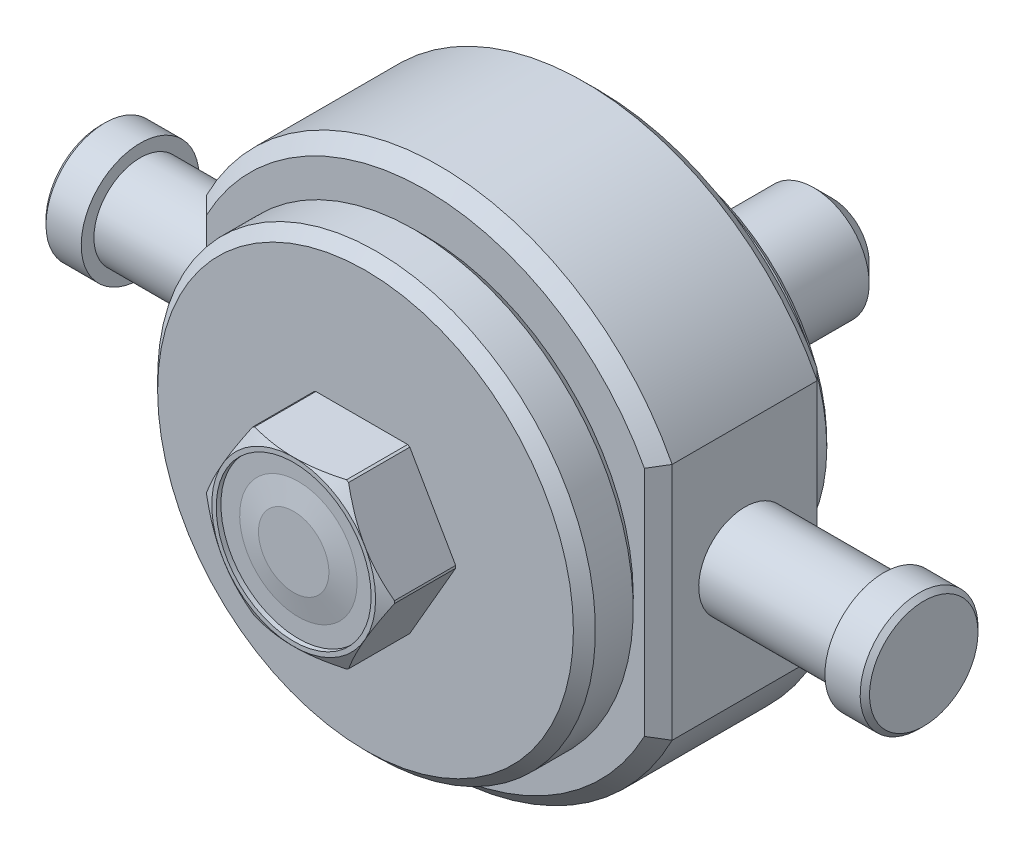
ISO-10303-21;
HEADER;
FILE_DESCRIPTION(('STEP AP214'),'2;1');
FILE_NAME('part.step','',(''),(''),'','','');
FILE_SCHEMA(('AUTOMOTIVE_DESIGN { 1 0 10303 214 1 1 1 1 }'));
ENDSEC;
DATA;
#1=APPLICATION_CONTEXT('core data for automotive mechanical design processes');
#2=APPLICATION_PROTOCOL_DEFINITION('international standard','automotive_design',2000,#1);
#3=PRODUCT_CONTEXT('',#1,'mechanical');
#4=PRODUCT('Part','Part','',(#3));
#5=PRODUCT_RELATED_PRODUCT_CATEGORY('part','',(#4));
#6=PRODUCT_DEFINITION_FORMATION('','',#4);
#7=PRODUCT_DEFINITION_CONTEXT('part definition',#1,'design');
#8=PRODUCT_DEFINITION('design','',#6,#7);
#9=PRODUCT_DEFINITION_SHAPE('','',#8);
#10=(LENGTH_UNIT() NAMED_UNIT(*) SI_UNIT(.MILLI.,.METRE.));
#11=(NAMED_UNIT(*) PLANE_ANGLE_UNIT() SI_UNIT($,.RADIAN.));
#12=(NAMED_UNIT(*) SI_UNIT($,.STERADIAN.) SOLID_ANGLE_UNIT());
#13=UNCERTAINTY_MEASURE_WITH_UNIT(LENGTH_MEASURE(1.E-05),#10,'distance_accuracy_value','');
#14=(GEOMETRIC_REPRESENTATION_CONTEXT(3) GLOBAL_UNCERTAINTY_ASSIGNED_CONTEXT((#13)) GLOBAL_UNIT_ASSIGNED_CONTEXT((#10,
#11,#12)) REPRESENTATION_CONTEXT('',''));
#15=CARTESIAN_POINT('',(0.,0.,0.));
#16=DIRECTION('',(0.,0.,1.));
#17=DIRECTION('',(1.,0.,0.));
#18=AXIS2_PLACEMENT_3D('',#15,#16,#17);
#19=CARTESIAN_POINT('',(-25.2,0.,46.7571734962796));
#20=DIRECTION('',(-1.,0.,0.));
#21=DIRECTION('',(0.,0.,1.));
#22=AXIS2_PLACEMENT_3D('',#19,#20,#21);
#23=PLANE('',#22);
#24=DIRECTION('',(0.,0.,-1.));
#25=VECTOR('',#24,1.);
#26=CARTESIAN_POINT('',(-25.2,12.9243584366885,25.019));
#27=LINE('',#26,#25);
#28=CARTESIAN_POINT('',(-25.2,12.9243584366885,7.8246));
#29=VERTEX_POINT('',#28);
#30=CARTESIAN_POINT('',(-25.2,12.9243584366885,23.519));
#31=VERTEX_POINT('',#30);
#32=EDGE_CURVE('E337',#29,#31,#27,.F.);
#33=ORIENTED_EDGE('',*,*,#32,.F.);
#34=DIRECTION('',(0.,-1.,0.));
#35=VECTOR('',#34,1.);
#36=CARTESIAN_POINT('',(-25.2,-9.1829211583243,7.8246));
#37=LINE('',#36,#35);
#38=CARTESIAN_POINT('',(-25.2,-12.9243584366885,7.8246));
#39=VERTEX_POINT('',#38);
#40=EDGE_CURVE('E9',#29,#39,#37,.T.);
#41=ORIENTED_EDGE('',*,*,#40,.T.);
#42=DIRECTION('',(0.,0.,-1.));
#43=VECTOR('',#42,1.);
#44=CARTESIAN_POINT('',(-25.2,-12.9243584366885,25.019));
#45=LINE('',#44,#43);
#46=CARTESIAN_POINT('',(-25.2,-12.9243584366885,23.519));
#47=VERTEX_POINT('',#46);
#48=EDGE_CURVE('E188',#47,#39,#45,.T.);
#49=ORIENTED_EDGE('',*,*,#48,.F.);
#50=DIRECTION('',(0.,1.,0.));
#51=VECTOR('',#50,1.);
#52=CARTESIAN_POINT('',(-25.2,0.,23.519));
#53=LINE('',#52,#51);
#54=EDGE_CURVE('E23',#47,#31,#53,.T.);
#55=ORIENTED_EDGE('',*,*,#54,.T.);
#56=EDGE_LOOP('',(#33,#41,#49,#55));
#57=FACE_BOUND('',#56,.T.);
#58=CARTESIAN_POINT('',(-25.2,0.,15.6464));
#59=DIRECTION('',(-1.,0.,0.));
#60=DIRECTION('',(0.,0.,1.));
#61=AXIS2_PLACEMENT_3D('',#58,#59,#60);
#62=CIRCLE('',#61,5.);
#63=CARTESIAN_POINT('',(-25.2,0.,20.6464));
#64=VERTEX_POINT('',#63);
#65=EDGE_CURVE('E341',#64,#64,#62,.F.);
#66=ORIENTED_EDGE('',*,*,#65,.T.);
#67=EDGE_LOOP('',(#66));
#68=FACE_BOUND('',#67,.T.);
#69=ADVANCED_FACE('F14',(#57,#68),#23,.T.);
#70=CARTESIAN_POINT('',(25.2,0.,46.7571734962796));
#71=DIRECTION('',(1.,0.,0.));
#72=DIRECTION('',(0.,0.,-1.));
#73=AXIS2_PLACEMENT_3D('',#70,#71,#72);
#74=PLANE('',#73);
#75=DIRECTION('',(0.,0.,-1.));
#76=VECTOR('',#75,1.);
#77=CARTESIAN_POINT('',(25.2,-12.9243584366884,25.019));
#78=LINE('',#77,#76);
#79=CARTESIAN_POINT('',(25.2,-12.9243584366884,7.8246));
#80=VERTEX_POINT('',#79);
#81=CARTESIAN_POINT('',(25.2,-12.9243584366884,23.519));
#82=VERTEX_POINT('',#81);
#83=EDGE_CURVE('E177',#80,#82,#78,.F.);
#84=ORIENTED_EDGE('',*,*,#83,.F.);
#85=DIRECTION('',(0.,1.,0.));
#86=VECTOR('',#85,1.);
#87=CARTESIAN_POINT('',(25.2,9.18292115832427,7.8246));
#88=LINE('',#87,#86);
#89=CARTESIAN_POINT('',(25.2,12.9243584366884,7.8246));
#90=VERTEX_POINT('',#89);
#91=EDGE_CURVE('E181',#80,#90,#88,.T.);
#92=ORIENTED_EDGE('',*,*,#91,.T.);
#93=DIRECTION('',(0.,0.,-1.));
#94=VECTOR('',#93,1.);
#95=CARTESIAN_POINT('',(25.2,12.9243584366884,25.019));
#96=LINE('',#95,#94);
#97=CARTESIAN_POINT('',(25.2,12.9243584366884,23.519));
#98=VERTEX_POINT('',#97);
#99=EDGE_CURVE('E343',#98,#90,#96,.T.);
#100=ORIENTED_EDGE('',*,*,#99,.F.);
#101=DIRECTION('',(0.,-1.,0.));
#102=VECTOR('',#101,1.);
#103=CARTESIAN_POINT('',(25.2,0.,23.519));
#104=LINE('',#103,#102);
#105=EDGE_CURVE('E184',#98,#82,#104,.T.);
#106=ORIENTED_EDGE('',*,*,#105,.T.);
#107=EDGE_LOOP('',(#84,#92,#100,#106));
#108=FACE_BOUND('',#107,.T.);
#109=CARTESIAN_POINT('',(25.2,0.,15.6464));
#110=DIRECTION('',(1.,0.,0.));
#111=DIRECTION('',(0.,0.,-1.));
#112=AXIS2_PLACEMENT_3D('',#109,#110,#111);
#113=CIRCLE('',#112,5.);
#114=CARTESIAN_POINT('',(25.2,0.,10.6464));
#115=VERTEX_POINT('',#114);
#116=EDGE_CURVE('E344',#115,#115,#113,.F.);
#117=ORIENTED_EDGE('',*,*,#116,.T.);
#118=EDGE_LOOP('',(#117));
#119=FACE_BOUND('',#118,.T.);
#120=ADVANCED_FACE('F178',(#108,#119),#74,.T.);
#121=CARTESIAN_POINT('',(0.,0.,25.019));
#122=DIRECTION('',(0.,0.,1.));
#123=DIRECTION('',(0.,-1.,0.));
#124=AXIS2_PLACEMENT_3D('',#121,#122,#123);
#125=PLANE('',#124);
#126=CARTESIAN_POINT('',(0.,0.,25.019));
#127=DIRECTION('',(0.,0.,1.));
#128=DIRECTION('',(0.,-1.,0.));
#129=AXIS2_PLACEMENT_3D('',#126,#127,#128);
#130=CIRCLE('',#129,22.49424);
#131=CARTESIAN_POINT('',(0.,-22.49424,25.019));
#132=VERTEX_POINT('',#131);
#133=EDGE_CURVE('E646',#132,#132,#130,.F.);
#134=ORIENTED_EDGE('',*,*,#133,.T.);
#135=EDGE_LOOP('',(#134));
#136=FACE_BOUND('',#135,.T.);
#137=CARTESIAN_POINT('',(0.,0.,25.019));
#138=DIRECTION('',(0.,0.,1.));
#139=DIRECTION('',(1.,0.,0.));
#140=AXIS2_PLACEMENT_3D('',#137,#138,#139);
#141=CIRCLE('',#140,26.821);
#142=CARTESIAN_POINT('',(-23.7,-12.5569120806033,25.019));
#143=VERTEX_POINT('',#142);
#144=CARTESIAN_POINT('',(23.7,-12.5569120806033,25.019));
#145=VERTEX_POINT('',#144);
#146=EDGE_CURVE('E353',#143,#145,#141,.T.);
#147=ORIENTED_EDGE('',*,*,#146,.T.);
#148=DIRECTION('',(0.,1.,0.));
#149=VECTOR('',#148,1.);
#150=CARTESIAN_POINT('',(23.7,0.,25.019));
#151=LINE('',#150,#149);
#152=CARTESIAN_POINT('',(23.7,12.5569120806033,25.019));
#153=VERTEX_POINT('',#152);
#154=EDGE_CURVE('E37',#145,#153,#151,.T.);
#155=ORIENTED_EDGE('',*,*,#154,.T.);
#156=CARTESIAN_POINT('',(-23.7,12.5569120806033,25.019));
#157=VERTEX_POINT('',#156);
#158=EDGE_CURVE('E352',#153,#157,#141,.T.);
#159=ORIENTED_EDGE('',*,*,#158,.T.);
#160=DIRECTION('',(0.,-1.,0.));
#161=VECTOR('',#160,1.);
#162=CARTESIAN_POINT('',(-23.7,0.,25.019));
#163=LINE('',#162,#161);
#164=EDGE_CURVE('E360',#157,#143,#163,.T.);
#165=ORIENTED_EDGE('',*,*,#164,.T.);
#166=EDGE_LOOP('',(#147,#155,#159,#165));
#167=FACE_BOUND('',#166,.T.);
#168=ADVANCED_FACE('F331',(#136,#167),#125,.T.);
#169=CARTESIAN_POINT('',(0.,0.,6.3246));
#170=DIRECTION('',(0.,0.,1.));
#171=DIRECTION('',(1.,0.,0.));
#172=AXIS2_PLACEMENT_3D('',#169,#170,#171);
#173=CONICAL_SURFACE('',#172,26.821,0.785398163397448);
#174=CARTESIAN_POINT('',(0.,0.,6.3246));
#175=DIRECTION('',(0.,0.,1.));
#176=DIRECTION('',(1.,0.,0.));
#177=AXIS2_PLACEMENT_3D('',#174,#175,#176);
#178=CIRCLE('',#177,26.821);
#179=CARTESIAN_POINT('',(-23.7,-12.5569120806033,6.3246));
#180=VERTEX_POINT('',#179);
#181=CARTESIAN_POINT('',(23.7,-12.5569120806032,6.3246));
#182=VERTEX_POINT('',#181);
#183=EDGE_CURVE('E166',#180,#182,#178,.T.);
#184=ORIENTED_EDGE('',*,*,#183,.T.);
#185=CARTESIAN_POINT('',(23.7,-12.5569120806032,6.3246));
#186=CARTESIAN_POINT('',(23.9498950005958,-12.6190104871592,6.57449500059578));
#187=CARTESIAN_POINT('',(24.1998425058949,-12.6806802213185,6.82444250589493));
#188=CARTESIAN_POINT('',(24.6998425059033,-12.803162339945,7.32444250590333));
#189=CARTESIAN_POINT('',(24.9498950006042,-12.8639747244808,7.57449500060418));
#190=CARTESIAN_POINT('',(25.2,-12.9243584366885,7.8246));
#191=B_SPLINE_CURVE_WITH_KNOTS('',3,(#185,#186,#187,#188,#189,#190),.UNSPECIFIED.,.F.,.F.,(4,2,
4),(0.,1.07645529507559,2.15291050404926),.UNSPECIFIED.);
#192=EDGE_CURVE('E160',#182,#80,#191,.T.);
#193=ORIENTED_EDGE('',*,*,#192,.T.);
#194=CARTESIAN_POINT('',(0.,0.,7.8246));
#195=DIRECTION('',(0.,0.,1.));
#196=DIRECTION('',(1.,0.,0.));
#197=AXIS2_PLACEMENT_3D('',#194,#195,#196);
#198=CIRCLE('',#197,28.321);
#199=EDGE_CURVE('E164',#39,#80,#198,.T.);
#200=ORIENTED_EDGE('',*,*,#199,.F.);
#201=CARTESIAN_POINT('',(-25.2,-12.9243584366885,7.8246));
#202=CARTESIAN_POINT('',(-24.9498950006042,-12.8639747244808,7.57449500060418));
#203=CARTESIAN_POINT('',(-24.6998425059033,-12.803162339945,7.32444250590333));
#204=CARTESIAN_POINT('',(-24.1998425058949,-12.6806802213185,6.82444250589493));
#205=CARTESIAN_POINT('',(-23.9498950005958,-12.6190104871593,6.57449500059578));
#206=CARTESIAN_POINT('',(-23.7,-12.5569120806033,6.3246));
#207=B_SPLINE_CURVE_WITH_KNOTS('',3,(#201,#202,#203,#204,#205,#206),.UNSPECIFIED.,.F.,.F.,(4,2,
4),(0.,1.07645520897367,2.15291050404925),.UNSPECIFIED.);
#208=EDGE_CURVE('E171',#39,#180,#207,.T.);
#209=ORIENTED_EDGE('',*,*,#208,.T.);
#210=EDGE_LOOP('',(#184,#193,#200,#209));
#211=FACE_BOUND('',#210,.T.);
#212=ADVANCED_FACE('F162',(#211),#173,.T.);
#213=CARTESIAN_POINT('',(0.,0.,23.519));
#214=DIRECTION('',(0.,0.,-1.));
#215=DIRECTION('',(-1.,0.,0.));
#216=AXIS2_PLACEMENT_3D('',#213,#214,#215);
#217=CONICAL_SURFACE('',#216,28.321,0.785398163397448);
#218=CARTESIAN_POINT('',(0.,0.,23.519));
#219=DIRECTION('',(0.,0.,1.));
#220=DIRECTION('',(1.,0.,0.));
#221=AXIS2_PLACEMENT_3D('',#218,#219,#220);
#222=CIRCLE('',#221,28.321);
#223=EDGE_CURVE('E354',#47,#82,#222,.T.);
#224=ORIENTED_EDGE('',*,*,#223,.T.);
#225=CARTESIAN_POINT('',(25.2,-12.9243584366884,23.519));
#226=CARTESIAN_POINT('',(24.9498950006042,-12.8639747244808,23.7691049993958));
#227=CARTESIAN_POINT('',(24.6998425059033,-12.803162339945,24.0191574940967));
#228=CARTESIAN_POINT('',(24.1998425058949,-12.6806802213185,24.5191574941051));
#229=CARTESIAN_POINT('',(23.9498950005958,-12.6190104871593,24.7691049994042));
#230=CARTESIAN_POINT('',(23.7,-12.5569120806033,25.019));
#231=B_SPLINE_CURVE_WITH_KNOTS('',3,(#225,#226,#227,#228,#229,#230),.UNSPECIFIED.,.F.,.F.,(4,2,
4),(0.,1.07645520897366,2.15291050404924),.UNSPECIFIED.);
#232=EDGE_CURVE('E365',#82,#145,#231,.T.);
#233=ORIENTED_EDGE('',*,*,#232,.T.);
#234=ORIENTED_EDGE('',*,*,#146,.F.);
#235=CARTESIAN_POINT('',(-23.7,-12.5569120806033,25.019));
#236=CARTESIAN_POINT('',(-23.9498950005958,-12.6190104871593,24.7691049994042));
#237=CARTESIAN_POINT('',(-24.1998425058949,-12.6806802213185,24.5191574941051));
#238=CARTESIAN_POINT('',(-24.6998425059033,-12.803162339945,24.0191574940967));
#239=CARTESIAN_POINT('',(-24.9498950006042,-12.8639747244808,23.7691049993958));
#240=CARTESIAN_POINT('',(-25.2,-12.9243584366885,23.519));
#241=B_SPLINE_CURVE_WITH_KNOTS('',3,(#235,#236,#237,#238,#239,#240),.UNSPECIFIED.,.F.,.F.,(4,2,
4),(0.,1.07645529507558,2.15291050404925),.UNSPECIFIED.);
#242=EDGE_CURVE('E170',#143,#47,#241,.T.);
#243=ORIENTED_EDGE('',*,*,#242,.T.);
#244=EDGE_LOOP('',(#224,#233,#234,#243));
#245=FACE_BOUND('',#244,.T.);
#246=ADVANCED_FACE('F392',(#245),#217,.T.);
#247=CARTESIAN_POINT('',(0.,0.,25.019));
#248=DIRECTION('',(0.,0.,-1.));
#249=DIRECTION('',(0.,1.,0.));
#250=AXIS2_PLACEMENT_3D('',#247,#248,#249);
#251=CYLINDRICAL_SURFACE('',#250,28.321);
#252=ORIENTED_EDGE('',*,*,#199,.T.);
#253=ORIENTED_EDGE('',*,*,#83,.T.);
#254=ORIENTED_EDGE('',*,*,#223,.F.);
#255=ORIENTED_EDGE('',*,*,#48,.T.);
#256=EDGE_LOOP('',(#252,#253,#254,#255));
#257=FACE_BOUND('',#256,.T.);
#258=ADVANCED_FACE('F191',(#257),#251,.T.);
#259=CARTESIAN_POINT('',(0.,0.,6.3246));
#260=DIRECTION('',(0.,0.,1.));
#261=DIRECTION('',(0.,-1.,0.));
#262=AXIS2_PLACEMENT_3D('',#259,#260,#261);
#263=PLANE('',#262);
#264=CARTESIAN_POINT('',(0.,0.,6.3246));
#265=DIRECTION('',(0.,0.,-1.));
#266=DIRECTION('',(0.,1.,0.));
#267=AXIS2_PLACEMENT_3D('',#264,#265,#266);
#268=CIRCLE('',#267,13.0467463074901);
#269=CARTESIAN_POINT('',(0.,13.0467463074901,6.3246));
#270=VERTEX_POINT('',#269);
#271=EDGE_CURVE('E302',#270,#270,#268,.T.);
#272=ORIENTED_EDGE('',*,*,#271,.F.);
#273=EDGE_LOOP('',(#272));
#274=FACE_BOUND('',#273,.T.);
#275=CARTESIAN_POINT('',(23.7,12.5569120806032,6.3246));
#276=VERTEX_POINT('',#275);
#277=CARTESIAN_POINT('',(-23.7,12.5569120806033,6.3246));
#278=VERTEX_POINT('',#277);
#279=EDGE_CURVE('E193',#276,#278,#178,.T.);
#280=ORIENTED_EDGE('',*,*,#279,.F.);
#281=DIRECTION('',(0.,-1.,0.));
#282=VECTOR('',#281,1.);
#283=CARTESIAN_POINT('',(23.7,-9.18292115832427,6.3246));
#284=LINE('',#283,#282);
#285=EDGE_CURVE('E245',#276,#182,#284,.T.);
#286=ORIENTED_EDGE('',*,*,#285,.T.);
#287=ORIENTED_EDGE('',*,*,#183,.F.);
#288=DIRECTION('',(0.,1.,0.));
#289=VECTOR('',#288,1.);
#290=CARTESIAN_POINT('',(-23.7,9.1829211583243,6.3246));
#291=LINE('',#290,#289);
#292=EDGE_CURVE('E246',#180,#278,#291,.T.);
#293=ORIENTED_EDGE('',*,*,#292,.T.);
#294=EDGE_LOOP('',(#280,#286,#287,#293));
#295=FACE_BOUND('',#294,.T.);
#296=ADVANCED_FACE('F254',(#274,#295),#263,.F.);
#297=CARTESIAN_POINT('',(58.693735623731,0.,15.6464));
#298=DIRECTION('',(-1.,0.,0.));
#299=DIRECTION('',(0.,-1.,0.));
#300=AXIS2_PLACEMENT_3D('',#297,#298,#299);
#301=CYLINDRICAL_SURFACE('',#300,5.);
#302=CARTESIAN_POINT('',(40.2336,0.,15.6464));
#303=DIRECTION('',(-1.,0.,0.));
#304=DIRECTION('',(0.,-1.,0.));
#305=AXIS2_PLACEMENT_3D('',#302,#303,#304);
#306=CIRCLE('',#305,5.);
#307=CARTESIAN_POINT('',(40.2336,-4.99999999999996,15.6464));
#308=VERTEX_POINT('',#307);
#309=EDGE_CURVE('E261',#308,#308,#306,.T.);
#310=ORIENTED_EDGE('',*,*,#309,.T.);
#311=EDGE_LOOP('',(#310));
#312=FACE_BOUND('',#311,.T.);
#313=ORIENTED_EDGE('',*,*,#116,.F.);
#314=EDGE_LOOP('',(#313));
#315=FACE_BOUND('',#314,.T.);
#316=ADVANCED_FACE('F1021',(#312,#315),#301,.T.);
#317=ORIENTED_EDGE('',*,*,#65,.F.);
#318=EDGE_LOOP('',(#317));
#319=FACE_BOUND('',#318,.T.);
#320=CARTESIAN_POINT('',(-40.2336,0.,15.6464));
#321=DIRECTION('',(1.,0.,0.));
#322=DIRECTION('',(0.,1.,0.));
#323=AXIS2_PLACEMENT_3D('',#320,#321,#322);
#324=CIRCLE('',#323,5.);
#325=CARTESIAN_POINT('',(-40.2336,5.,15.6464));
#326=VERTEX_POINT('',#325);
#327=EDGE_CURVE('E264',#326,#326,#324,.T.);
#328=ORIENTED_EDGE('',*,*,#327,.T.);
#329=EDGE_LOOP('',(#328));
#330=FACE_BOUND('',#329,.T.);
#331=ADVANCED_FACE('F225',(#319,#330),#301,.T.);
#332=EDGE_CURVE('E194',#90,#29,#198,.T.);
#333=ORIENTED_EDGE('',*,*,#332,.F.);
#334=CARTESIAN_POINT('',(25.2,12.9243584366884,7.8246));
#335=CARTESIAN_POINT('',(24.9498950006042,12.8639747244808,7.57449500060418));
#336=CARTESIAN_POINT('',(24.6998425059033,12.803162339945,7.32444250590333));
#337=CARTESIAN_POINT('',(24.1998425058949,12.6806802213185,6.82444250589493));
#338=CARTESIAN_POINT('',(23.9498950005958,12.6190104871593,6.57449500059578));
#339=CARTESIAN_POINT('',(23.7,12.5569120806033,6.3246));
#340=B_SPLINE_CURVE_WITH_KNOTS('',3,(#334,#335,#336,#337,#338,#339),.UNSPECIFIED.,.F.,.F.,(4,2,
4),(0.,1.07645520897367,2.15291050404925),.UNSPECIFIED.);
#341=EDGE_CURVE('E197',#90,#276,#340,.T.);
#342=ORIENTED_EDGE('',*,*,#341,.T.);
#343=ORIENTED_EDGE('',*,*,#279,.T.);
#344=CARTESIAN_POINT('',(-23.7,12.5569120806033,6.3246));
#345=CARTESIAN_POINT('',(-23.9498950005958,12.6190104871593,6.57449500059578));
#346=CARTESIAN_POINT('',(-24.1998425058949,12.6806802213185,6.82444250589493));
#347=CARTESIAN_POINT('',(-24.6998425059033,12.803162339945,7.32444250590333));
#348=CARTESIAN_POINT('',(-24.9498950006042,12.8639747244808,7.57449500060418));
#349=CARTESIAN_POINT('',(-25.2,12.9243584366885,7.8246));
#350=B_SPLINE_CURVE_WITH_KNOTS('',3,(#344,#345,#346,#347,#348,#349),.UNSPECIFIED.,.F.,.F.,(4,2,
4),(0.,1.07645529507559,2.15291050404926),.UNSPECIFIED.);
#351=EDGE_CURVE('E198',#278,#29,#350,.T.);
#352=ORIENTED_EDGE('',*,*,#351,.T.);
#353=EDGE_LOOP('',(#333,#342,#343,#352));
#354=FACE_BOUND('',#353,.T.);
#355=ADVANCED_FACE('F219',(#354),#173,.T.);
#356=ORIENTED_EDGE('',*,*,#158,.F.);
#357=CARTESIAN_POINT('',(23.7,12.5569120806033,25.019));
#358=CARTESIAN_POINT('',(23.9498950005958,12.6190104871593,24.7691049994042));
#359=CARTESIAN_POINT('',(24.1998425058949,12.6806802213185,24.5191574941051));
#360=CARTESIAN_POINT('',(24.6998425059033,12.803162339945,24.0191574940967));
#361=CARTESIAN_POINT('',(24.9498950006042,12.8639747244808,23.7691049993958));
#362=CARTESIAN_POINT('',(25.2,12.9243584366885,23.519));
#363=B_SPLINE_CURVE_WITH_KNOTS('',3,(#357,#358,#359,#360,#361,#362),.UNSPECIFIED.,.F.,.F.,(4,2,
4),(0.,1.07645529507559,2.15291050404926),.UNSPECIFIED.);
#364=EDGE_CURVE('E366',#153,#98,#363,.T.);
#365=ORIENTED_EDGE('',*,*,#364,.T.);
#366=EDGE_CURVE('E355',#98,#31,#222,.T.);
#367=ORIENTED_EDGE('',*,*,#366,.T.);
#368=CARTESIAN_POINT('',(-25.2,12.9243584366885,23.519));
#369=CARTESIAN_POINT('',(-24.9498950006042,12.8639747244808,23.7691049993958));
#370=CARTESIAN_POINT('',(-24.6998425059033,12.803162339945,24.0191574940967));
#371=CARTESIAN_POINT('',(-24.1998425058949,12.6806802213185,24.5191574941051));
#372=CARTESIAN_POINT('',(-23.9498950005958,12.6190104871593,24.7691049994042));
#373=CARTESIAN_POINT('',(-23.7,12.5569120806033,25.019));
#374=B_SPLINE_CURVE_WITH_KNOTS('',3,(#368,#369,#370,#371,#372,#373),.UNSPECIFIED.,.F.,.F.,(4,2,
4),(0.,1.07645520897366,2.15291050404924),.UNSPECIFIED.);
#375=EDGE_CURVE('E30',#31,#157,#374,.T.);
#376=ORIENTED_EDGE('',*,*,#375,.T.);
#377=EDGE_LOOP('',(#356,#365,#367,#376));
#378=FACE_BOUND('',#377,.T.);
#379=ADVANCED_FACE('F224',(#378),#217,.T.);
#380=ORIENTED_EDGE('',*,*,#366,.F.);
#381=ORIENTED_EDGE('',*,*,#99,.T.);
#382=ORIENTED_EDGE('',*,*,#332,.T.);
#383=ORIENTED_EDGE('',*,*,#32,.T.);
#384=EDGE_LOOP('',(#380,#381,#382,#383));
#385=FACE_BOUND('',#384,.T.);
#386=ADVANCED_FACE('F281',(#385),#251,.T.);
#387=CARTESIAN_POINT('',(8.8646,0.,39.2684));
#388=DIRECTION('',(0.,0.,1.));
#389=DIRECTION('',(-1.,0.,0.));
#390=AXIS2_PLACEMENT_3D('',#387,#388,#389);
#391=PLANE('',#390);
#392=CARTESIAN_POINT('',(0.,0.,39.2684000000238));
#393=DIRECTION('',(0.,0.,-1.));
#394=DIRECTION('',(0.,1.,0.));
#395=AXIS2_PLACEMENT_3D('',#392,#393,#394);
#396=CIRCLE('',#395,3.8099999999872);
#397=CARTESIAN_POINT('',(0.,3.8099999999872,39.2684000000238));
#398=VERTEX_POINT('',#397);
#399=EDGE_CURVE('E267',#398,#398,#396,.T.);
#400=ORIENTED_EDGE('',*,*,#399,.F.);
#401=EDGE_LOOP('',(#400));
#402=FACE_BOUND('',#401,.T.);
#403=ADVANCED_FACE('F406',(#402),#391,.T.);
#404=CARTESIAN_POINT('',(0.,0.,38.7604000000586));
#405=DIRECTION('',(0.,0.,-1.));
#406=DIRECTION('',(0.,1.,0.));
#407=AXIS2_PLACEMENT_3D('',#404,#405,#406);
#408=CONICAL_SURFACE('',#407,6.3499999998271,1.37340076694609);
#409=ORIENTED_EDGE('',*,*,#399,.T.);
#410=EDGE_LOOP('',(#409));
#411=FACE_BOUND('',#410,.T.);
#412=CARTESIAN_POINT('',(0.,0.,38.7604000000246));
#413=DIRECTION('',(0.,0.,-1.));
#414=DIRECTION('',(0.,1.,0.));
#415=AXIS2_PLACEMENT_3D('',#412,#413,#414);
#416=CIRCLE('',#415,6.34999999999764);
#417=CARTESIAN_POINT('',(0.,6.34999999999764,38.7604000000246));
#418=VERTEX_POINT('',#417);
#419=EDGE_CURVE('E722',#418,#418,#416,.T.);
#420=ORIENTED_EDGE('',*,*,#419,.F.);
#421=EDGE_LOOP('',(#420));
#422=FACE_BOUND('',#421,.T.);
#423=ADVANCED_FACE('F413',(#411,#422),#408,.T.);
#424=CARTESIAN_POINT('',(0.,-6.35,38.7604));
#425=DIRECTION('',(0.,0.,1.));
#426=DIRECTION('',(-1.,0.,0.));
#427=AXIS2_PLACEMENT_3D('',#424,#425,#426);
#428=PLANE('',#427);
#429=CARTESIAN_POINT('',(0.,0.,38.7604));
#430=DIRECTION('',(0.,0.,-1.));
#431=DIRECTION('',(1.,0.,0.));
#432=AXIS2_PLACEMENT_3D('',#429,#430,#431);
#433=CIRCLE('',#432,8.382);
#434=CARTESIAN_POINT('',(8.38200000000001,0.,38.7604));
#435=VERTEX_POINT('',#434);
#436=EDGE_CURVE('E719',#435,#435,#433,.F.);
#437=ORIENTED_EDGE('',*,*,#436,.T.);
#438=EDGE_LOOP('',(#437));
#439=FACE_BOUND('',#438,.T.);
#440=ORIENTED_EDGE('',*,*,#419,.T.);
#441=EDGE_LOOP('',(#440));
#442=FACE_BOUND('',#441,.T.);
#443=ADVANCED_FACE('F729',(#439,#442),#428,.T.);
#444=CARTESIAN_POINT('',(0.,0.,3.4798));
#445=DIRECTION('',(0.,0.,-1.));
#446=DIRECTION('',(1.,0.,0.));
#447=AXIS2_PLACEMENT_3D('',#444,#445,#446);
#448=CYLINDRICAL_SURFACE('',#447,8.382);
#449=ORIENTED_EDGE('',*,*,#436,.F.);
#450=EDGE_LOOP('',(#449));
#451=FACE_BOUND('',#450,.T.);
#452=CARTESIAN_POINT('',(0.,0.,39.2684));
#453=DIRECTION('',(0.,0.,-1.));
#454=DIRECTION('',(1.,0.,0.));
#455=AXIS2_PLACEMENT_3D('',#452,#453,#454);
#456=CIRCLE('',#455,8.382);
#457=CARTESIAN_POINT('',(8.38200000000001,0.,39.2684));
#458=VERTEX_POINT('',#457);
#459=EDGE_CURVE('E716',#458,#458,#456,.T.);
#460=ORIENTED_EDGE('',*,*,#459,.F.);
#461=EDGE_LOOP('',(#460));
#462=FACE_BOUND('',#461,.T.);
#463=ADVANCED_FACE('F734',(#451,#462),#448,.F.);
#464=CARTESIAN_POINT('',(8.8646,0.,39.2684));
#465=DIRECTION('',(0.,0.,1.));
#466=DIRECTION('',(-1.,0.,0.));
#467=AXIS2_PLACEMENT_3D('',#464,#465,#466);
#468=PLANE('',#467);
#469=CARTESIAN_POINT('',(0.,0.,39.2684));
#470=DIRECTION('',(0.,0.,-1.));
#471=DIRECTION('',(1.,0.,0.));
#472=AXIS2_PLACEMENT_3D('',#469,#470,#471);
#473=CIRCLE('',#472,8.8646);
#474=CARTESIAN_POINT('',(8.86460000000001,0.,39.2684));
#475=VERTEX_POINT('',#474);
#476=EDGE_CURVE('E635',#475,#475,#473,.T.);
#477=ORIENTED_EDGE('',*,*,#476,.F.);
#478=EDGE_LOOP('',(#477));
#479=FACE_BOUND('',#478,.T.);
#480=ORIENTED_EDGE('',*,*,#459,.T.);
#481=EDGE_LOOP('',(#480));
#482=FACE_BOUND('',#481,.T.);
#483=ADVANCED_FACE('F741',(#479,#482),#468,.T.);
#484=CARTESIAN_POINT('',(0.,0.,-18.4912));
#485=DIRECTION('',(0.,0.,1.));
#486=DIRECTION('',(0.,-1.,0.));
#487=AXIS2_PLACEMENT_3D('',#484,#485,#486);
#488=CYLINDRICAL_SURFACE('',#487,10.16);
#489=CARTESIAN_POINT('',(0.,0.,38.5205004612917));
#490=DIRECTION('',(0.,0.,-1.));
#491=DIRECTION('',(1.,0.,0.));
#492=AXIS2_PLACEMENT_3D('',#489,#490,#491);
#493=CIRCLE('',#492,10.16);
#494=CARTESIAN_POINT('',(-10.1591177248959,0.133891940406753,38.5205004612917));
#495=VERTEX_POINT('',#494);
#496=CARTESIAN_POINT('',(-10.1591177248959,-0.133891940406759,38.5205004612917));
#497=VERTEX_POINT('',#496);
#498=EDGE_CURVE('E628',#495,#497,#493,.F.);
#499=ORIENTED_EDGE('',*,*,#498,.F.);
#500=DIRECTION('',(0.,0.,1.));
#501=VECTOR('',#500,1.);
#502=CARTESIAN_POINT('',(-10.1591177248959,0.133891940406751,-18.4912));
#503=LINE('',#502,#501);
#504=CARTESIAN_POINT('',(-10.1591177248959,0.13389194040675,31.9024));
#505=VERTEX_POINT('',#504);
#506=EDGE_CURVE('E554',#505,#495,#503,.T.);
#507=ORIENTED_EDGE('',*,*,#506,.F.);
#508=CARTESIAN_POINT('',(0.,0.,31.9024));
#509=DIRECTION('',(0.,0.,1.));
#510=DIRECTION('',(0.,-1.,0.));
#511=AXIS2_PLACEMENT_3D('',#508,#509,#510);
#512=CIRCLE('',#511,10.16);
#513=CARTESIAN_POINT('',(-10.1591177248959,-0.133891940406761,31.9024));
#514=VERTEX_POINT('',#513);
#515=EDGE_CURVE('E714',#505,#514,#512,.T.);
#516=ORIENTED_EDGE('',*,*,#515,.T.);
#517=DIRECTION('',(0.,0.,1.));
#518=VECTOR('',#517,1.);
#519=CARTESIAN_POINT('',(-10.1591177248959,-0.133891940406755,-18.4912));
#520=LINE('',#519,#518);
#521=EDGE_CURVE('E621',#497,#514,#520,.F.);
#522=ORIENTED_EDGE('',*,*,#521,.F.);
#523=EDGE_LOOP('',(#499,#507,#516,#522));
#524=FACE_BOUND('',#523,.T.);
#525=ADVANCED_FACE('F747',(#524),#488,.T.);
#526=CARTESIAN_POINT('',(0.,0.,-18.4912));
#527=DIRECTION('',(0.,0.,1.));
#528=DIRECTION('',(0.,-1.,0.));
#529=AXIS2_PLACEMENT_3D('',#526,#527,#528);
#530=CYLINDRICAL_SURFACE('',#529,10.16);
#531=DIRECTION('',(0.,0.,1.));
#532=VECTOR('',#531,1.);
#533=CARTESIAN_POINT('',(-5.19551268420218,8.73110805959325,-18.4912));
#534=LINE('',#533,#532);
#535=CARTESIAN_POINT('',(-5.19551268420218,8.73110805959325,38.5205004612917));
#536=VERTEX_POINT('',#535);
#537=CARTESIAN_POINT('',(-5.19551268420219,8.73110805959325,31.9024));
#538=VERTEX_POINT('',#537);
#539=EDGE_CURVE('E616',#536,#538,#534,.F.);
#540=ORIENTED_EDGE('',*,*,#539,.F.);
#541=CARTESIAN_POINT('',(0.,0.,38.5205004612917));
#542=DIRECTION('',(0.,0.,-1.));
#543=DIRECTION('',(1.,0.,0.));
#544=AXIS2_PLACEMENT_3D('',#541,#542,#543);
#545=CIRCLE('',#544,10.16);
#546=CARTESIAN_POINT('',(-4.96360504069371,8.865,38.5205004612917));
#547=VERTEX_POINT('',#546);
#548=EDGE_CURVE('E591',#547,#536,#545,.F.);
#549=ORIENTED_EDGE('',*,*,#548,.F.);
#550=DIRECTION('',(0.,0.,1.));
#551=VECTOR('',#550,1.);
#552=CARTESIAN_POINT('',(-4.9636050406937,8.865,-18.4912));
#553=LINE('',#552,#551);
#554=CARTESIAN_POINT('',(-4.9636050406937,8.865,31.9024));
#555=VERTEX_POINT('',#554);
#556=EDGE_CURVE('E611',#555,#547,#553,.T.);
#557=ORIENTED_EDGE('',*,*,#556,.F.);
#558=CARTESIAN_POINT('',(0.,0.,31.9024));
#559=DIRECTION('',(0.,0.,1.));
#560=DIRECTION('',(0.,-1.,0.));
#561=AXIS2_PLACEMENT_3D('',#558,#559,#560);
#562=CIRCLE('',#561,10.16);
#563=EDGE_CURVE('E712',#555,#538,#562,.T.);
#564=ORIENTED_EDGE('',*,*,#563,.T.);
#565=EDGE_LOOP('',(#540,#549,#557,#564));
#566=FACE_BOUND('',#565,.T.);
#567=ADVANCED_FACE('F751',(#566),#530,.T.);
#568=CARTESIAN_POINT('',(0.,0.,-18.4912));
#569=DIRECTION('',(0.,0.,1.));
#570=DIRECTION('',(0.,-1.,0.));
#571=AXIS2_PLACEMENT_3D('',#568,#569,#570);
#572=CYLINDRICAL_SURFACE('',#571,10.16);
#573=DIRECTION('',(0.,0.,1.));
#574=VECTOR('',#573,1.);
#575=CARTESIAN_POINT('',(4.96360504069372,8.865,-18.4912));
#576=LINE('',#575,#574);
#577=CARTESIAN_POINT('',(4.96360504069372,8.865,38.5205004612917));
#578=VERTEX_POINT('',#577);
#579=CARTESIAN_POINT('',(4.96360504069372,8.865,31.9024));
#580=VERTEX_POINT('',#579);
#581=EDGE_CURVE('E553',#578,#580,#576,.F.);
#582=ORIENTED_EDGE('',*,*,#581,.F.);
#583=CARTESIAN_POINT('',(0.,0.,38.5205004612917));
#584=DIRECTION('',(0.,0.,-1.));
#585=DIRECTION('',(1.,0.,0.));
#586=AXIS2_PLACEMENT_3D('',#583,#584,#585);
#587=CIRCLE('',#586,10.16);
#588=CARTESIAN_POINT('',(5.19551268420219,8.73110805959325,38.5205004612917));
#589=VERTEX_POINT('',#588);
#590=EDGE_CURVE('E586',#589,#578,#587,.F.);
#591=ORIENTED_EDGE('',*,*,#590,.F.);
#592=DIRECTION('',(0.,0.,1.));
#593=VECTOR('',#592,1.);
#594=CARTESIAN_POINT('',(5.1955126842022,8.73110805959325,-18.4912));
#595=LINE('',#594,#593);
#596=CARTESIAN_POINT('',(5.1955126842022,8.73110805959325,31.9024));
#597=VERTEX_POINT('',#596);
#598=EDGE_CURVE('E575',#597,#589,#595,.T.);
#599=ORIENTED_EDGE('',*,*,#598,.F.);
#600=CARTESIAN_POINT('',(0.,0.,31.9024));
#601=DIRECTION('',(0.,0.,1.));
#602=DIRECTION('',(0.,-1.,0.));
#603=AXIS2_PLACEMENT_3D('',#600,#601,#602);
#604=CIRCLE('',#603,10.16);
#605=EDGE_CURVE('E592',#597,#580,#604,.T.);
#606=ORIENTED_EDGE('',*,*,#605,.T.);
#607=EDGE_LOOP('',(#582,#591,#599,#606));
#608=FACE_BOUND('',#607,.T.);
#609=ADVANCED_FACE('F587',(#608),#572,.T.);
#610=CARTESIAN_POINT('',(0.,0.,-18.4912));
#611=DIRECTION('',(0.,0.,1.));
#612=DIRECTION('',(0.,-1.,0.));
#613=AXIS2_PLACEMENT_3D('',#610,#611,#612);
#614=CYLINDRICAL_SURFACE('',#613,10.16);
#615=DIRECTION('',(0.,0.,1.));
#616=VECTOR('',#615,1.);
#617=CARTESIAN_POINT('',(10.1591177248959,0.133891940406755,-18.4912));
#618=LINE('',#617,#616);
#619=CARTESIAN_POINT('',(10.1591177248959,0.133891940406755,38.5205004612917));
#620=VERTEX_POINT('',#619);
#621=CARTESIAN_POINT('',(10.1591177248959,0.133891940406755,31.9024));
#622=VERTEX_POINT('',#621);
#623=EDGE_CURVE('E583',#620,#622,#618,.F.);
#624=ORIENTED_EDGE('',*,*,#623,.F.);
#625=CARTESIAN_POINT('',(0.,0.,38.5205004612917));
#626=DIRECTION('',(0.,0.,-1.));
#627=DIRECTION('',(1.,0.,0.));
#628=AXIS2_PLACEMENT_3D('',#625,#626,#627);
#629=CIRCLE('',#628,10.16);
#630=CARTESIAN_POINT('',(10.1591177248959,-0.133891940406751,38.5205004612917));
#631=VERTEX_POINT('',#630);
#632=EDGE_CURVE('E598',#631,#620,#629,.F.);
#633=ORIENTED_EDGE('',*,*,#632,.F.);
#634=DIRECTION('',(0.,0.,1.));
#635=VECTOR('',#634,1.);
#636=CARTESIAN_POINT('',(10.1591177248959,-0.133891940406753,-18.4912));
#637=LINE('',#636,#635);
#638=CARTESIAN_POINT('',(10.1591177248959,-0.133891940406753,31.9024));
#639=VERTEX_POINT('',#638);
#640=EDGE_CURVE('E601',#639,#631,#637,.T.);
#641=ORIENTED_EDGE('',*,*,#640,.F.);
#642=CARTESIAN_POINT('',(0.,0.,31.9024));
#643=DIRECTION('',(0.,0.,1.));
#644=DIRECTION('',(0.,-1.,0.));
#645=AXIS2_PLACEMENT_3D('',#642,#643,#644);
#646=CIRCLE('',#645,10.16);
#647=EDGE_CURVE('E633',#639,#622,#646,.T.);
#648=ORIENTED_EDGE('',*,*,#647,.T.);
#649=EDGE_LOOP('',(#624,#633,#641,#648));
#650=FACE_BOUND('',#649,.T.);
#651=ADVANCED_FACE('F758',(#650),#614,.T.);
#652=CARTESIAN_POINT('',(0.,0.,-18.4912));
#653=DIRECTION('',(0.,0.,1.));
#654=DIRECTION('',(0.,-1.,0.));
#655=AXIS2_PLACEMENT_3D('',#652,#653,#654);
#656=CYLINDRICAL_SURFACE('',#655,10.16);
#657=DIRECTION('',(0.,0.,1.));
#658=VECTOR('',#657,1.);
#659=CARTESIAN_POINT('',(-4.96360504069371,-8.865,-18.4912));
#660=LINE('',#659,#658);
#661=CARTESIAN_POINT('',(-4.96360504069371,-8.865,38.5205004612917));
#662=VERTEX_POINT('',#661);
#663=CARTESIAN_POINT('',(-4.96360504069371,-8.865,31.9024));
#664=VERTEX_POINT('',#663);
#665=EDGE_CURVE('E696',#662,#664,#660,.F.);
#666=ORIENTED_EDGE('',*,*,#665,.F.);
#667=CARTESIAN_POINT('',(0.,0.,38.5205004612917));
#668=DIRECTION('',(0.,0.,-1.));
#669=DIRECTION('',(1.,0.,0.));
#670=AXIS2_PLACEMENT_3D('',#667,#668,#669);
#671=CIRCLE('',#670,10.16);
#672=CARTESIAN_POINT('',(-5.19551268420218,-8.73110805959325,38.5205004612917));
#673=VERTEX_POINT('',#672);
#674=EDGE_CURVE('E626',#673,#662,#671,.F.);
#675=ORIENTED_EDGE('',*,*,#674,.F.);
#676=DIRECTION('',(0.,0.,1.));
#677=VECTOR('',#676,1.);
#678=CARTESIAN_POINT('',(-5.19551268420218,-8.73110805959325,-18.4912));
#679=LINE('',#678,#677);
#680=CARTESIAN_POINT('',(-5.19551268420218,-8.73110805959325,31.9024));
#681=VERTEX_POINT('',#680);
#682=EDGE_CURVE('E619',#681,#673,#679,.T.);
#683=ORIENTED_EDGE('',*,*,#682,.F.);
#684=CARTESIAN_POINT('',(0.,0.,31.9024));
#685=DIRECTION('',(0.,0.,1.));
#686=DIRECTION('',(0.,-1.,0.));
#687=AXIS2_PLACEMENT_3D('',#684,#685,#686);
#688=CIRCLE('',#687,10.16);
#689=EDGE_CURVE('E705',#681,#664,#688,.T.);
#690=ORIENTED_EDGE('',*,*,#689,.T.);
#691=EDGE_LOOP('',(#666,#675,#683,#690));
#692=FACE_BOUND('',#691,.T.);
#693=ADVANCED_FACE('F760',(#692),#656,.T.);
#694=CARTESIAN_POINT('',(0.,0.,-18.4912));
#695=DIRECTION('',(0.,0.,1.));
#696=DIRECTION('',(0.,-1.,0.));
#697=AXIS2_PLACEMENT_3D('',#694,#695,#696);
#698=CYLINDRICAL_SURFACE('',#697,10.16);
#699=DIRECTION('',(0.,0.,1.));
#700=VECTOR('',#699,1.);
#701=CARTESIAN_POINT('',(5.1955126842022,-8.73110805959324,-18.4912));
#702=LINE('',#701,#700);
#703=CARTESIAN_POINT('',(5.1955126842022,-8.73110805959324,38.5205004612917));
#704=VERTEX_POINT('',#703);
#705=CARTESIAN_POINT('',(5.1955126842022,-8.73110805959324,31.9024));
#706=VERTEX_POINT('',#705);
#707=EDGE_CURVE('E599',#704,#706,#702,.F.);
#708=ORIENTED_EDGE('',*,*,#707,.F.);
#709=CARTESIAN_POINT('',(0.,0.,38.5205004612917));
#710=DIRECTION('',(0.,0.,-1.));
#711=DIRECTION('',(1.,0.,0.));
#712=AXIS2_PLACEMENT_3D('',#709,#710,#711);
#713=CIRCLE('',#712,10.16);
#714=CARTESIAN_POINT('',(4.96360504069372,-8.865,38.5205004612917));
#715=VERTEX_POINT('',#714);
#716=EDGE_CURVE('E624',#715,#704,#713,.F.);
#717=ORIENTED_EDGE('',*,*,#716,.F.);
#718=DIRECTION('',(0.,0.,1.));
#719=VECTOR('',#718,1.);
#720=CARTESIAN_POINT('',(4.96360504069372,-8.865,-18.4912));
#721=LINE('',#720,#719);
#722=CARTESIAN_POINT('',(4.96360504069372,-8.865,31.9024));
#723=VERTEX_POINT('',#722);
#724=EDGE_CURVE('E502',#723,#715,#721,.T.);
#725=ORIENTED_EDGE('',*,*,#724,.F.);
#726=CARTESIAN_POINT('',(0.,0.,31.9024));
#727=DIRECTION('',(0.,0.,1.));
#728=DIRECTION('',(0.,-1.,0.));
#729=AXIS2_PLACEMENT_3D('',#726,#727,#728);
#730=CIRCLE('',#729,10.16);
#731=EDGE_CURVE('E704',#723,#706,#730,.T.);
#732=ORIENTED_EDGE('',*,*,#731,.T.);
#733=EDGE_LOOP('',(#708,#717,#725,#732));
#734=FACE_BOUND('',#733,.T.);
#735=ADVANCED_FACE('F517',(#734),#698,.T.);
#736=CARTESIAN_POINT('',(0.,0.,38.5205004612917));
#737=DIRECTION('',(0.,0.,-1.));
#738=DIRECTION('',(1.,0.,0.));
#739=AXIS2_PLACEMENT_3D('',#736,#737,#738);
#740=CONICAL_SURFACE('',#739,10.16,1.0471975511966);
#741=CARTESIAN_POINT('',(-10.1591177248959,0.133891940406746,38.5205004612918));
#742=CARTESIAN_POINT('',(-10.0472520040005,0.327649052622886,38.5835945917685));
#743=CARTESIAN_POINT('',(-9.9349702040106,0.522126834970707,38.6436960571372));
#744=CARTESIAN_POINT('',(-9.70951508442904,0.912626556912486,38.7571038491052));
#745=CARTESIAN_POINT('',(-9.59634148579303,1.10864897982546,38.8104079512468));
#746=CARTESIAN_POINT('',(-9.2550636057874,1.69975960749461,38.959041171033));
#747=CARTESIAN_POINT('',(-9.02563569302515,2.0971404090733,39.0428401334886));
#748=CARTESIAN_POINT('',(-8.68231540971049,2.69178858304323,39.1397776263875));
#749=CARTESIAN_POINT('',(-8.56939648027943,2.88736990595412,39.1671288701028));
#750=CARTESIAN_POINT('',(-8.34308930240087,3.27934543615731,39.2123535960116));
#751=CARTESIAN_POINT('',(-8.22970111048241,3.47573954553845,39.2302281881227));
#752=CARTESIAN_POINT('',(-8.00276001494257,3.8688130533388,39.2560464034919));
#753=CARTESIAN_POINT('',(-7.88920740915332,4.06549193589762,39.2640004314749));
#754=CARTESIAN_POINT('',(-7.66204559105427,4.45894774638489,39.2698201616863));
#755=CARTESIAN_POINT('',(-7.54843638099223,4.65572467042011,39.2676862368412));
#756=CARTESIAN_POINT('',(-7.24732192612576,5.17727020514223,39.2486814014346));
#757=CARTESIAN_POINT('',(-7.05993941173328,5.50182624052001,39.2231079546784));
#758=CARTESIAN_POINT('',(-6.68639824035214,6.14881852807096,39.1461362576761));
#759=CARTESIAN_POINT('',(-6.50024063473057,6.47125295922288,39.0947181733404));
#760=CARTESIAN_POINT('',(-6.12611647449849,7.11925501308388,38.9678154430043));
#761=CARTESIAN_POINT('',(-5.93819064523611,7.44475209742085,38.891860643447));
#762=CARTESIAN_POINT('',(-5.56493313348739,8.09125307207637,38.7201135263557));
#763=CARTESIAN_POINT('',(-5.37959764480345,8.41226355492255,38.6243545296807));
#764=CARTESIAN_POINT('',(-5.19551268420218,8.73110805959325,38.5205004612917));
#765=B_SPLINE_CURVE_WITH_KNOTS('',3,(#741,#742,#743,#744,#745,#746,#747,#748,#749,#750,#751,
#752,#753,#754,#755,#756,#757,#758,#759,#760,#761,#762,#763,#764),.UNSPECIFIED.,.F.,.F.,(4,2,2,
2,2,2,2,2,2,2,2,4),(0.,0.697316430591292,1.39486047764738,2.79265164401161,3.4749553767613,
4.15717917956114,4.83868686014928,5.52016934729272,6.64604463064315,7.77278527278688,
8.92254188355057,10.0703795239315),.UNSPECIFIED.);
#766=EDGE_CURVE('E547',#495,#536,#765,.T.);
#767=ORIENTED_EDGE('',*,*,#766,.F.);
#768=ORIENTED_EDGE('',*,*,#498,.T.);
#769=CARTESIAN_POINT('',(-5.19551268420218,-8.73110805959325,38.5205004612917));
#770=CARTESIAN_POINT('',(-5.30737840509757,-8.53735094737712,38.5835945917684));
#771=CARTESIAN_POINT('',(-5.41966020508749,-8.3428731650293,38.6436960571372));
#772=CARTESIAN_POINT('',(-5.64511532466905,-7.95237344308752,38.7571038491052));
#773=CARTESIAN_POINT('',(-5.75828892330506,-7.75635102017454,38.8104079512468));
#774=CARTESIAN_POINT('',(-6.09956680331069,-7.16524039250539,38.959041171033));
#775=CARTESIAN_POINT('',(-6.32899471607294,-6.7678595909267,39.0428401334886));
#776=CARTESIAN_POINT('',(-6.6723149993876,-6.17321141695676,39.1397776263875));
#777=CARTESIAN_POINT('',(-6.78523392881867,-5.97763009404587,39.1671288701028));
#778=CARTESIAN_POINT('',(-7.01154110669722,-5.58565456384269,39.2123535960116));
#779=CARTESIAN_POINT('',(-7.12492929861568,-5.38926045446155,39.2302281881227));
#780=CARTESIAN_POINT('',(-7.35187039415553,-4.99618694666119,39.2560464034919));
#781=CARTESIAN_POINT('',(-7.46542299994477,-4.79950806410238,39.2640004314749));
#782=CARTESIAN_POINT('',(-7.69258481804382,-4.4060522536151,39.2698201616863));
#783=CARTESIAN_POINT('',(-7.80619402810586,-4.20927532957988,39.2676862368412));
#784=CARTESIAN_POINT('',(-8.10730848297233,-3.68772979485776,39.2486814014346));
#785=CARTESIAN_POINT('',(-8.29469099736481,-3.36317375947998,39.2231079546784));
#786=CARTESIAN_POINT('',(-8.66823216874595,-2.71618147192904,39.1461362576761));
#787=CARTESIAN_POINT('',(-8.85438977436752,-2.39374704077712,39.0947181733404));
#788=CARTESIAN_POINT('',(-9.2285139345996,-1.74574498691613,38.9678154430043));
#789=CARTESIAN_POINT('',(-9.41643976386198,-1.42024790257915,38.891860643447));
#790=CARTESIAN_POINT('',(-9.7896972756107,-0.773746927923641,38.7201135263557));
#791=CARTESIAN_POINT('',(-9.97503276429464,-0.452736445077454,38.6243545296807));
#792=CARTESIAN_POINT('',(-10.1591177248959,-0.133891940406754,38.5205004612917));
#793=B_SPLINE_CURVE_WITH_KNOTS('',3,(#769,#770,#771,#772,#773,#774,#775,#776,#777,#778,#779,
#780,#781,#782,#783,#784,#785,#786,#787,#788,#789,#790,#791,#792),.UNSPECIFIED.,.F.,.F.,(4,2,2,
2,2,2,2,2,2,2,2,4),(0.,0.697316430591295,1.39486047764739,2.79265164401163,3.47495537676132,
4.15717917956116,4.8386868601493,5.52016934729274,6.64604463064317,7.77278527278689,
8.92254188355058,10.0703795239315),.UNSPECIFIED.);
#794=EDGE_CURVE('E525',#673,#497,#793,.T.);
#795=ORIENTED_EDGE('',*,*,#794,.F.);
#796=ORIENTED_EDGE('',*,*,#674,.T.);
#797=CARTESIAN_POINT('',(4.96360504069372,-8.865,38.5205004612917));
#798=CARTESIAN_POINT('',(4.73987359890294,-8.865,38.5835945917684));
#799=CARTESIAN_POINT('',(4.51530999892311,-8.865,38.6436960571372));
#800=CARTESIAN_POINT('',(4.06439975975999,-8.865,38.7571038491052));
#801=CARTESIAN_POINT('',(3.83805256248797,-8.865,38.8104079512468));
#802=CARTESIAN_POINT('',(3.15549680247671,-8.865,38.959041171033));
#803=CARTESIAN_POINT('',(2.69664097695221,-8.865,39.0428401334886));
#804=CARTESIAN_POINT('',(2.01000041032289,-8.865,39.1397776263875));
#805=CARTESIAN_POINT('',(1.78416255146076,-8.865,39.1671288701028));
#806=CARTESIAN_POINT('',(1.33154819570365,-8.865,39.2123535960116));
#807=CARTESIAN_POINT('',(1.10477181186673,-8.865,39.2302281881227));
#808=CARTESIAN_POINT('',(0.65088962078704,-8.865,39.2560464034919));
#809=CARTESIAN_POINT('',(0.423784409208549,-8.865,39.2640004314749));
#810=CARTESIAN_POINT('',(-0.0305392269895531,-8.865,39.2698201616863));
#811=CARTESIAN_POINT('',(-0.257757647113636,-8.865,39.2676862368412));
#812=CARTESIAN_POINT('',(-0.859986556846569,-8.865,39.2486814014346));
#813=CARTESIAN_POINT('',(-1.23475158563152,-8.865,39.2231079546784));
#814=CARTESIAN_POINT('',(-1.98183392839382,-8.865,39.1461362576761));
#815=CARTESIAN_POINT('',(-2.35414913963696,-8.865,39.0947181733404));
#816=CARTESIAN_POINT('',(-3.10239746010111,-8.865,38.9678154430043));
#817=CARTESIAN_POINT('',(-3.47824911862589,-8.865,38.891860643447));
#818=CARTESIAN_POINT('',(-4.22476414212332,-8.865,38.7201135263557));
#819=CARTESIAN_POINT('',(-4.5954351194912,-8.865,38.6243545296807));
#820=CARTESIAN_POINT('',(-4.96360504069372,-8.865,38.5205004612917));
#821=B_SPLINE_CURVE_WITH_KNOTS('',3,(#797,#798,#799,#800,#801,#802,#803,#804,#805,#806,#807,
#808,#809,#810,#811,#812,#813,#814,#815,#816,#817,#818,#819,#820),.UNSPECIFIED.,.F.,.F.,(4,2,2,
2,2,2,2,2,2,2,2,4),(0.,0.697316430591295,1.39486047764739,2.79265164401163,3.47495537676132,
4.15717917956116,4.83868686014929,5.52016934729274,6.64604463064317,7.7727852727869,
8.92254188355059,10.0703795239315),.UNSPECIFIED.);
#822=EDGE_CURVE('E492',#715,#662,#821,.T.);
#823=ORIENTED_EDGE('',*,*,#822,.F.);
#824=ORIENTED_EDGE('',*,*,#716,.T.);
#825=CARTESIAN_POINT('',(10.1591177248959,-0.133891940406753,38.5205004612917));
#826=CARTESIAN_POINT('',(10.0472520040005,-0.327649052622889,38.5835945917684));
#827=CARTESIAN_POINT('',(9.9349702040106,-0.522126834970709,38.6436960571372));
#828=CARTESIAN_POINT('',(9.70951508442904,-0.912626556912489,38.7571038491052));
#829=CARTESIAN_POINT('',(9.59634148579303,-1.10864897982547,38.8104079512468));
#830=CARTESIAN_POINT('',(9.2550636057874,-1.69975960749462,38.959041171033));
#831=CARTESIAN_POINT('',(9.02563569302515,-2.09714040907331,39.0428401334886));
#832=CARTESIAN_POINT('',(8.68231540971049,-2.69178858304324,39.1397776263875));
#833=CARTESIAN_POINT('',(8.56939648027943,-2.88736990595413,39.1671288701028));
#834=CARTESIAN_POINT('',(8.34308930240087,-3.27934543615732,39.2123535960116));
#835=CARTESIAN_POINT('',(8.22970111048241,-3.47573954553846,39.2302281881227));
#836=CARTESIAN_POINT('',(8.00276001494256,-3.86881305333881,39.2560464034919));
#837=CARTESIAN_POINT('',(7.88920740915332,-4.06549193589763,39.2640004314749));
#838=CARTESIAN_POINT('',(7.66204559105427,-4.4589477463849,39.2698201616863));
#839=CARTESIAN_POINT('',(7.54843638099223,-4.65572467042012,39.2676862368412));
#840=CARTESIAN_POINT('',(7.24732192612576,-5.17727020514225,39.2486814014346));
#841=CARTESIAN_POINT('',(7.05993941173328,-5.50182624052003,39.2231079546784));
#842=CARTESIAN_POINT('',(6.68639824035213,-6.14881852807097,39.1461362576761));
#843=CARTESIAN_POINT('',(6.50024063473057,-6.47125295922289,39.0947181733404));
#844=CARTESIAN_POINT('',(6.1261164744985,-7.11925501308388,38.9678154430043));
#845=CARTESIAN_POINT('',(5.93819064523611,-7.44475209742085,38.891860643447));
#846=CARTESIAN_POINT('',(5.5649331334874,-8.09125307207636,38.7201135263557));
#847=CARTESIAN_POINT('',(5.37959764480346,-8.41226355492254,38.6243545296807));
#848=CARTESIAN_POINT('',(5.1955126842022,-8.73110805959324,38.5205004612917));
#849=B_SPLINE_CURVE_WITH_KNOTS('',3,(#825,#826,#827,#828,#829,#830,#831,#832,#833,#834,#835,
#836,#837,#838,#839,#840,#841,#842,#843,#844,#845,#846,#847,#848),.UNSPECIFIED.,.F.,.F.,(4,2,2,
2,2,2,2,2,2,2,2,4),(0.,0.697316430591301,1.39486047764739,2.79265164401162,3.47495537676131,
4.15717917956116,4.83868686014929,5.52016934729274,6.64604463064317,7.77278527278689,
8.92254188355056,10.0703795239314),.UNSPECIFIED.);
#850=EDGE_CURVE('E505',#631,#704,#849,.T.);
#851=ORIENTED_EDGE('',*,*,#850,.F.);
#852=ORIENTED_EDGE('',*,*,#632,.T.);
#853=CARTESIAN_POINT('',(5.19551268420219,8.73110805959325,38.5205004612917));
#854=CARTESIAN_POINT('',(5.30737840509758,8.53735094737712,38.5835945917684));
#855=CARTESIAN_POINT('',(5.41966020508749,8.3428731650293,38.6436960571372));
#856=CARTESIAN_POINT('',(5.64511532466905,7.95237344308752,38.7571038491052));
#857=CARTESIAN_POINT('',(5.75828892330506,7.75635102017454,38.8104079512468));
#858=CARTESIAN_POINT('',(6.09956680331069,7.16524039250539,38.959041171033));
#859=CARTESIAN_POINT('',(6.32899471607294,6.7678595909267,39.0428401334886));
#860=CARTESIAN_POINT('',(6.6723149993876,6.17321141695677,39.1397776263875));
#861=CARTESIAN_POINT('',(6.78523392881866,5.97763009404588,39.1671288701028));
#862=CARTESIAN_POINT('',(7.01154110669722,5.58565456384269,39.2123535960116));
#863=CARTESIAN_POINT('',(7.12492929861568,5.38926045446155,39.2302281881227));
#864=CARTESIAN_POINT('',(7.35187039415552,4.9961869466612,39.2560464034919));
#865=CARTESIAN_POINT('',(7.46542299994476,4.79950806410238,39.2640004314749));
#866=CARTESIAN_POINT('',(7.69258481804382,4.40605225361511,39.2698201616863));
#867=CARTESIAN_POINT('',(7.80619402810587,4.20927532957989,39.2676862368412));
#868=CARTESIAN_POINT('',(8.10730848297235,3.68772979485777,39.2486814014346));
#869=CARTESIAN_POINT('',(8.29469099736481,3.36317375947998,39.2231079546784));
#870=CARTESIAN_POINT('',(8.66823216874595,2.71618147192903,39.1461362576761));
#871=CARTESIAN_POINT('',(8.85438977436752,2.39374704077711,39.0947181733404));
#872=CARTESIAN_POINT('',(9.2285139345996,1.74574498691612,38.9678154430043));
#873=CARTESIAN_POINT('',(9.41643976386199,1.42024790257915,38.891860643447));
#874=CARTESIAN_POINT('',(9.78969727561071,0.773746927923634,38.7201135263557));
#875=CARTESIAN_POINT('',(9.97503276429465,0.452736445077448,38.6243545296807));
#876=CARTESIAN_POINT('',(10.1591177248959,0.133891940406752,38.5205004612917));
#877=B_SPLINE_CURVE_WITH_KNOTS('',3,(#853,#854,#855,#856,#857,#858,#859,#860,#861,#862,#863,
#864,#865,#866,#867,#868,#869,#870,#871,#872,#873,#874,#875,#876),.UNSPECIFIED.,.F.,.F.,(4,2,2,
2,2,2,2,2,2,2,2,4),(0.,0.697316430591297,1.39486047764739,2.79265164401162,3.47495537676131,
4.15717917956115,4.83868686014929,5.52016934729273,6.64604463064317,7.7727852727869,
8.92254188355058,10.0703795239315),.UNSPECIFIED.);
#878=EDGE_CURVE('E534',#589,#620,#877,.T.);
#879=ORIENTED_EDGE('',*,*,#878,.F.);
#880=ORIENTED_EDGE('',*,*,#590,.T.);
#881=CARTESIAN_POINT('',(-4.96360504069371,8.865,38.5205004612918));
#882=CARTESIAN_POINT('',(-4.73987359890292,8.865,38.5835945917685));
#883=CARTESIAN_POINT('',(-4.51530999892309,8.865,38.6436960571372));
#884=CARTESIAN_POINT('',(-4.06439975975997,8.865,38.7571038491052));
#885=CARTESIAN_POINT('',(-3.83805256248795,8.865,38.8104079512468));
#886=CARTESIAN_POINT('',(-3.15549680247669,8.865,38.959041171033));
#887=CARTESIAN_POINT('',(-2.6966409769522,8.865,39.0428401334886));
#888=CARTESIAN_POINT('',(-2.01000041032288,8.865,39.1397776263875));
#889=CARTESIAN_POINT('',(-1.78416255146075,8.865,39.1671288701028));
#890=CARTESIAN_POINT('',(-1.33154819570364,8.865,39.2123535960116));
#891=CARTESIAN_POINT('',(-1.10477181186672,8.865,39.2302281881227));
#892=CARTESIAN_POINT('',(-0.650889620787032,8.865,39.2560464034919));
#893=CARTESIAN_POINT('',(-0.423784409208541,8.865,39.2640004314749));
#894=CARTESIAN_POINT('',(0.0305392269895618,8.865,39.2698201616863));
#895=CARTESIAN_POINT('',(0.257757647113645,8.865,39.2676862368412));
#896=CARTESIAN_POINT('',(0.85998655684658,8.865,39.2486814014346));
#897=CARTESIAN_POINT('',(1.23475158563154,8.865,39.2231079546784));
#898=CARTESIAN_POINT('',(1.98183392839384,8.865,39.1461362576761));
#899=CARTESIAN_POINT('',(2.35414913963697,8.865,39.0947181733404));
#900=CARTESIAN_POINT('',(3.10239746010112,8.865,38.9678154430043));
#901=CARTESIAN_POINT('',(3.47824911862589,8.865,38.891860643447));
#902=CARTESIAN_POINT('',(4.22476414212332,8.865,38.7201135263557));
#903=CARTESIAN_POINT('',(4.5954351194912,8.865,38.6243545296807));
#904=CARTESIAN_POINT('',(4.96360504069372,8.865,38.5205004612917));
#905=B_SPLINE_CURVE_WITH_KNOTS('',3,(#881,#882,#883,#884,#885,#886,#887,#888,#889,#890,#891,
#892,#893,#894,#895,#896,#897,#898,#899,#900,#901,#902,#903,#904),.UNSPECIFIED.,.F.,.F.,(4,2,2,
2,2,2,2,2,2,2,2,4),(0.,0.697316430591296,1.39486047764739,2.79265164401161,3.4749553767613,
4.15717917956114,4.83868686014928,5.52016934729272,6.64604463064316,7.77278527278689,
8.92254188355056,10.0703795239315),.UNSPECIFIED.);
#906=EDGE_CURVE('E541',#547,#578,#905,.T.);
#907=ORIENTED_EDGE('',*,*,#906,.F.);
#908=ORIENTED_EDGE('',*,*,#548,.T.);
#909=EDGE_LOOP('',(#767,#768,#795,#796,#823,#824,#851,#852,#879,#880,#907,#908));
#910=FACE_BOUND('',#909,.T.);
#911=ORIENTED_EDGE('',*,*,#476,.T.);
#912=EDGE_LOOP('',(#911));
#913=FACE_BOUND('',#912,.T.);
#914=ADVANCED_FACE('F511',(#910,#913),#740,.T.);
#915=CARTESIAN_POINT('',(-10.1591177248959,-0.133891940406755,-18.4912));
#916=DIRECTION('',(-0.866025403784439,-0.5,0.));
#917=DIRECTION('',(0.5,-0.866025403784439,0.));
#918=AXIS2_PLACEMENT_3D('',#915,#916,#917);
#919=PLANE('',#918);
#920=ORIENTED_EDGE('',*,*,#682,.T.);
#921=ORIENTED_EDGE('',*,*,#794,.T.);
#922=ORIENTED_EDGE('',*,*,#521,.T.);
#923=DIRECTION('',(-0.5,0.866025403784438,0.));
#924=VECTOR('',#923,1.);
#925=CARTESIAN_POINT('',(-5.19551268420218,-8.73110805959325,31.9024));
#926=LINE('',#925,#924);
#927=EDGE_CURVE('E501',#681,#514,#926,.T.);
#928=ORIENTED_EDGE('',*,*,#927,.F.);
#929=EDGE_LOOP('',(#920,#921,#922,#928));
#930=FACE_BOUND('',#929,.T.);
#931=ADVANCED_FACE('F516',(#930),#919,.T.);
#932=CARTESIAN_POINT('',(-5.19551268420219,8.73110805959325,-18.4912));
#933=DIRECTION('',(-0.866025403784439,0.5,0.));
#934=DIRECTION('',(-0.5,-0.866025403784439,0.));
#935=AXIS2_PLACEMENT_3D('',#932,#933,#934);
#936=PLANE('',#935);
#937=ORIENTED_EDGE('',*,*,#506,.T.);
#938=ORIENTED_EDGE('',*,*,#766,.T.);
#939=ORIENTED_EDGE('',*,*,#539,.T.);
#940=DIRECTION('',(0.5,0.866025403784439,0.));
#941=VECTOR('',#940,1.);
#942=CARTESIAN_POINT('',(-10.1591177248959,0.133891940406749,31.9024));
#943=LINE('',#942,#941);
#944=EDGE_CURVE('E691',#505,#538,#943,.T.);
#945=ORIENTED_EDGE('',*,*,#944,.F.);
#946=EDGE_LOOP('',(#937,#938,#939,#945));
#947=FACE_BOUND('',#946,.T.);
#948=ADVANCED_FACE('F555',(#947),#936,.T.);
#949=CARTESIAN_POINT('',(4.96360504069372,8.865,-18.4912));
#950=DIRECTION('',(0.,1.,0.));
#951=DIRECTION('',(-1.,0.,0.));
#952=AXIS2_PLACEMENT_3D('',#949,#950,#951);
#953=PLANE('',#952);
#954=ORIENTED_EDGE('',*,*,#556,.T.);
#955=ORIENTED_EDGE('',*,*,#906,.T.);
#956=ORIENTED_EDGE('',*,*,#581,.T.);
#957=DIRECTION('',(1.,0.,0.));
#958=VECTOR('',#957,1.);
#959=CARTESIAN_POINT('',(8.3058,8.865,31.9024));
#960=LINE('',#959,#958);
#961=EDGE_CURVE('E688',#555,#580,#960,.T.);
#962=ORIENTED_EDGE('',*,*,#961,.F.);
#963=EDGE_LOOP('',(#954,#955,#956,#962));
#964=FACE_BOUND('',#963,.T.);
#965=ADVANCED_FACE('F558',(#964),#953,.T.);
#966=CARTESIAN_POINT('',(10.1591177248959,0.133891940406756,-18.4912));
#967=DIRECTION('',(0.866025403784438,0.5,0.));
#968=DIRECTION('',(-0.5,0.866025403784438,0.));
#969=AXIS2_PLACEMENT_3D('',#966,#967,#968);
#970=PLANE('',#969);
#971=ORIENTED_EDGE('',*,*,#598,.T.);
#972=ORIENTED_EDGE('',*,*,#878,.T.);
#973=ORIENTED_EDGE('',*,*,#623,.T.);
#974=DIRECTION('',(0.5,-0.866025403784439,0.));
#975=VECTOR('',#974,1.);
#976=CARTESIAN_POINT('',(5.1955126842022,8.73110805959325,31.9024));
#977=LINE('',#976,#975);
#978=EDGE_CURVE('E581',#597,#622,#977,.T.);
#979=ORIENTED_EDGE('',*,*,#978,.F.);
#980=EDGE_LOOP('',(#971,#972,#973,#979));
#981=FACE_BOUND('',#980,.T.);
#982=ADVANCED_FACE('F562',(#981),#970,.T.);
#983=CARTESIAN_POINT('',(5.1955126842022,-8.73110805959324,-18.4912));
#984=DIRECTION('',(0.866025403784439,-0.5,0.));
#985=DIRECTION('',(0.5,0.866025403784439,0.));
#986=AXIS2_PLACEMENT_3D('',#983,#984,#985);
#987=PLANE('',#986);
#988=ORIENTED_EDGE('',*,*,#640,.T.);
#989=ORIENTED_EDGE('',*,*,#850,.T.);
#990=ORIENTED_EDGE('',*,*,#707,.T.);
#991=DIRECTION('',(-0.5,-0.866025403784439,0.));
#992=VECTOR('',#991,1.);
#993=CARTESIAN_POINT('',(10.1591177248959,-0.133891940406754,31.9024));
#994=LINE('',#993,#992);
#995=EDGE_CURVE('E680',#639,#706,#994,.T.);
#996=ORIENTED_EDGE('',*,*,#995,.F.);
#997=EDGE_LOOP('',(#988,#989,#990,#996));
#998=FACE_BOUND('',#997,.T.);
#999=ADVANCED_FACE('F487',(#998),#987,.T.);
#1000=CARTESIAN_POINT('',(-4.96360504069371,-8.865,-18.4912));
#1001=DIRECTION('',(0.,-1.,0.));
#1002=DIRECTION('',(1.,0.,0.));
#1003=AXIS2_PLACEMENT_3D('',#1000,#1001,#1002);
#1004=PLANE('',#1003);
#1005=ORIENTED_EDGE('',*,*,#724,.T.);
#1006=ORIENTED_EDGE('',*,*,#822,.T.);
#1007=ORIENTED_EDGE('',*,*,#665,.T.);
#1008=DIRECTION('',(1.,0.,0.));
#1009=VECTOR('',#1008,1.);
#1010=CARTESIAN_POINT('',(8.3058,-8.865,31.9024));
#1011=LINE('',#1010,#1009);
#1012=EDGE_CURVE('E676',#723,#664,#1011,.F.);
#1013=ORIENTED_EDGE('',*,*,#1012,.F.);
#1014=EDGE_LOOP('',(#1005,#1006,#1007,#1013));
#1015=FACE_BOUND('',#1014,.T.);
#1016=ADVANCED_FACE('F478',(#1015),#1004,.T.);
#1017=CARTESIAN_POINT('',(8.3058,0.,31.9024));
#1018=DIRECTION('',(0.,0.,-1.));
#1019=DIRECTION('',(1.,0.,0.));
#1020=AXIS2_PLACEMENT_3D('',#1017,#1018,#1019);
#1021=PLANE('',#1020);
#1022=ORIENTED_EDGE('',*,*,#1012,.T.);
#1023=ORIENTED_EDGE('',*,*,#689,.F.);
#1024=ORIENTED_EDGE('',*,*,#927,.T.);
#1025=ORIENTED_EDGE('',*,*,#515,.F.);
#1026=ORIENTED_EDGE('',*,*,#944,.T.);
#1027=ORIENTED_EDGE('',*,*,#563,.F.);
#1028=ORIENTED_EDGE('',*,*,#961,.T.);
#1029=ORIENTED_EDGE('',*,*,#605,.F.);
#1030=ORIENTED_EDGE('',*,*,#978,.T.);
#1031=ORIENTED_EDGE('',*,*,#647,.F.);
#1032=ORIENTED_EDGE('',*,*,#995,.T.);
#1033=ORIENTED_EDGE('',*,*,#731,.F.);
#1034=EDGE_LOOP('',(#1022,#1023,#1024,#1025,#1026,#1027,#1028,#1029,#1030,#1031,#1032,#1033));
#1035=FACE_BOUND('',#1034,.T.);
#1036=CARTESIAN_POINT('',(0.,0.,31.9024));
#1037=DIRECTION('',(0.,0.,1.));
#1038=DIRECTION('',(-1.,0.,0.));
#1039=AXIS2_PLACEMENT_3D('',#1036,#1037,#1038);
#1040=CIRCLE('',#1039,8.3058);
#1041=CARTESIAN_POINT('',(-8.30579999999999,0.,31.9024));
#1042=VERTEX_POINT('',#1041);
#1043=EDGE_CURVE('E668',#1042,#1042,#1040,.F.);
#1044=ORIENTED_EDGE('',*,*,#1043,.F.);
#1045=EDGE_LOOP('',(#1044));
#1046=FACE_BOUND('',#1045,.T.);
#1047=ADVANCED_FACE('F469',(#1035,#1046),#1021,.T.);
#1048=CARTESIAN_POINT('',(0.,0.,-18.4912));
#1049=DIRECTION('',(0.,0.,1.));
#1050=DIRECTION('',(-1.,0.,0.));
#1051=AXIS2_PLACEMENT_3D('',#1048,#1049,#1050);
#1052=CYLINDRICAL_SURFACE('',#1051,8.3058);
#1053=ORIENTED_EDGE('',*,*,#1043,.T.);
#1054=EDGE_LOOP('',(#1053));
#1055=FACE_BOUND('',#1054,.T.);
#1056=CARTESIAN_POINT('',(0.,0.,31.496));
#1057=DIRECTION('',(0.,0.,1.));
#1058=DIRECTION('',(-1.,0.,0.));
#1059=AXIS2_PLACEMENT_3D('',#1056,#1057,#1058);
#1060=CIRCLE('',#1059,8.3058);
#1061=CARTESIAN_POINT('',(-8.30579999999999,0.,31.496));
#1062=VERTEX_POINT('',#1061);
#1063=EDGE_CURVE('E664',#1062,#1062,#1060,.F.);
#1064=ORIENTED_EDGE('',*,*,#1063,.F.);
#1065=EDGE_LOOP('',(#1064));
#1066=FACE_BOUND('',#1065,.T.);
#1067=ADVANCED_FACE('F458',(#1055,#1066),#1052,.T.);
#1068=CARTESIAN_POINT('',(22.49424,0.,31.496));
#1069=DIRECTION('',(0.,0.,1.));
#1070=DIRECTION('',(0.,-1.,0.));
#1071=AXIS2_PLACEMENT_3D('',#1068,#1069,#1070);
#1072=PLANE('',#1071);
#1073=ORIENTED_EDGE('',*,*,#1063,.T.);
#1074=EDGE_LOOP('',(#1073));
#1075=FACE_BOUND('',#1074,.T.);
#1076=CARTESIAN_POINT('',(0.,0.,31.496));
#1077=DIRECTION('',(0.,0.,-1.));
#1078=DIRECTION('',(0.,1.,0.));
#1079=AXIS2_PLACEMENT_3D('',#1076,#1077,#1078);
#1080=CIRCLE('',#1079,22.49424);
#1081=CARTESIAN_POINT('',(0.,22.49424,31.496));
#1082=VERTEX_POINT('',#1081);
#1083=EDGE_CURVE('E655',#1082,#1082,#1080,.T.);
#1084=ORIENTED_EDGE('',*,*,#1083,.F.);
#1085=EDGE_LOOP('',(#1084));
#1086=FACE_BOUND('',#1085,.T.);
#1087=ADVANCED_FACE('F448',(#1075,#1086),#1072,.T.);
#1088=CARTESIAN_POINT('',(0.,0.,30.30474));
#1089=DIRECTION('',(0.,0.,-1.));
#1090=DIRECTION('',(0.,1.,0.));
#1091=AXIS2_PLACEMENT_3D('',#1088,#1089,#1090);
#1092=CONICAL_SURFACE('',#1091,23.6855,0.785398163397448);
#1093=ORIENTED_EDGE('',*,*,#1083,.T.);
#1094=EDGE_LOOP('',(#1093));
#1095=FACE_BOUND('',#1094,.T.);
#1096=CARTESIAN_POINT('',(0.,0.,30.30474));
#1097=DIRECTION('',(0.,0.,-1.));
#1098=DIRECTION('',(0.,1.,0.));
#1099=AXIS2_PLACEMENT_3D('',#1096,#1097,#1098);
#1100=CIRCLE('',#1099,23.6855);
#1101=CARTESIAN_POINT('',(0.,23.6855,30.30474));
#1102=VERTEX_POINT('',#1101);
#1103=EDGE_CURVE('E654',#1102,#1102,#1100,.T.);
#1104=ORIENTED_EDGE('',*,*,#1103,.F.);
#1105=EDGE_LOOP('',(#1104));
#1106=FACE_BOUND('',#1105,.T.);
#1107=ADVANCED_FACE('F430',(#1095,#1106),#1092,.T.);
#1108=CARTESIAN_POINT('',(0.,0.,25.019));
#1109=DIRECTION('',(0.,0.,-1.));
#1110=DIRECTION('',(0.,1.,0.));
#1111=AXIS2_PLACEMENT_3D('',#1108,#1109,#1110);
#1112=CYLINDRICAL_SURFACE('',#1111,23.6855);
#1113=ORIENTED_EDGE('',*,*,#1103,.T.);
#1114=EDGE_LOOP('',(#1113));
#1115=FACE_BOUND('',#1114,.T.);
#1116=CARTESIAN_POINT('',(0.,0.,26.21026));
#1117=DIRECTION('',(0.,0.,1.));
#1118=DIRECTION('',(0.,-1.,0.));
#1119=AXIS2_PLACEMENT_3D('',#1116,#1117,#1118);
#1120=CIRCLE('',#1119,23.6855);
#1121=CARTESIAN_POINT('',(0.,-23.6855,26.21026));
#1122=VERTEX_POINT('',#1121);
#1123=EDGE_CURVE('E653',#1122,#1122,#1120,.F.);
#1124=ORIENTED_EDGE('',*,*,#1123,.F.);
#1125=EDGE_LOOP('',(#1124));
#1126=FACE_BOUND('',#1125,.T.);
#1127=ADVANCED_FACE('F419',(#1115,#1126),#1112,.T.);
#1128=CARTESIAN_POINT('',(0.,0.,26.21026));
#1129=DIRECTION('',(0.,0.,1.));
#1130=DIRECTION('',(0.,-1.,0.));
#1131=AXIS2_PLACEMENT_3D('',#1128,#1129,#1130);
#1132=CONICAL_SURFACE('',#1131,23.6855,0.78539816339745);
#1133=ORIENTED_EDGE('',*,*,#133,.F.);
#1134=EDGE_LOOP('',(#1133));
#1135=FACE_BOUND('',#1134,.T.);
#1136=ORIENTED_EDGE('',*,*,#1123,.T.);
#1137=EDGE_LOOP('',(#1136));
#1138=FACE_BOUND('',#1137,.T.);
#1139=ADVANCED_FACE('F407',(#1135,#1138),#1132,.T.);
#1140=CARTESIAN_POINT('',(44.5516,0.,15.6464));
#1141=DIRECTION('',(-1.,0.,0.));
#1142=DIRECTION('',(0.,-1.,0.));
#1143=AXIS2_PLACEMENT_3D('',#1140,#1141,#1142);
#1144=PLANE('',#1143);
#1145=CARTESIAN_POINT('',(44.5515999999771,0.,15.6464));
#1146=DIRECTION('',(-1.,0.,0.));
#1147=DIRECTION('',(0.,0.,-1.));
#1148=AXIS2_PLACEMENT_3D('',#1145,#1146,#1147);
#1149=CIRCLE('',#1148,5.86740000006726);
#1150=CARTESIAN_POINT('',(44.551599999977,0.,9.77899999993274));
#1151=VERTEX_POINT('',#1150);
#1152=EDGE_CURVE('E671',#1151,#1151,#1149,.T.);
#1153=ORIENTED_EDGE('',*,*,#1152,.F.);
#1154=EDGE_LOOP('',(#1153));
#1155=FACE_BOUND('',#1154,.T.);
#1156=ADVANCED_FACE('F416',(#1155),#1144,.F.);
#1157=CARTESIAN_POINT('',(44.0436000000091,0.,15.6464));
#1158=DIRECTION('',(-1.,0.,0.));
#1159=DIRECTION('',(0.,0.,-1.));
#1160=AXIS2_PLACEMENT_3D('',#1157,#1158,#1159);
#1161=CONICAL_SURFACE('',#1160,6.37540000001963,0.785398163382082);
#1162=CARTESIAN_POINT('',(44.0436,0.,15.6464));
#1163=DIRECTION('',(1.,0.,0.));
#1164=DIRECTION('',(0.,1.,0.));
#1165=AXIS2_PLACEMENT_3D('',#1162,#1163,#1164);
#1166=CIRCLE('',#1165,6.3754);
#1167=CARTESIAN_POINT('',(44.0436,6.37540000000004,15.6464));
#1168=VERTEX_POINT('',#1167);
#1169=EDGE_CURVE('E667',#1168,#1168,#1166,.F.);
#1170=ORIENTED_EDGE('',*,*,#1169,.F.);
#1171=EDGE_LOOP('',(#1170));
#1172=FACE_BOUND('',#1171,.T.);
#1173=ORIENTED_EDGE('',*,*,#1152,.T.);
#1174=EDGE_LOOP('',(#1173));
#1175=FACE_BOUND('',#1174,.T.);
#1176=ADVANCED_FACE('F427',(#1172,#1175),#1161,.T.);
#1177=CARTESIAN_POINT('',(44.5516,0.,15.6464));
#1178=DIRECTION('',(1.,0.,0.));
#1179=DIRECTION('',(0.,1.,0.));
#1180=AXIS2_PLACEMENT_3D('',#1177,#1178,#1179);
#1181=CYLINDRICAL_SURFACE('',#1180,6.3754);
#1182=ORIENTED_EDGE('',*,*,#1169,.T.);
#1183=EDGE_LOOP('',(#1182));
#1184=FACE_BOUND('',#1183,.T.);
#1185=CARTESIAN_POINT('',(40.2336,0.,15.6464));
#1186=DIRECTION('',(1.,0.,0.));
#1187=DIRECTION('',(0.,1.,0.));
#1188=AXIS2_PLACEMENT_3D('',#1185,#1186,#1187);
#1189=CIRCLE('',#1188,6.3754);
#1190=CARTESIAN_POINT('',(40.2336,6.37540000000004,15.6464));
#1191=VERTEX_POINT('',#1190);
#1192=EDGE_CURVE('E658',#1191,#1191,#1189,.T.);
#1193=ORIENTED_EDGE('',*,*,#1192,.T.);
#1194=EDGE_LOOP('',(#1193));
#1195=FACE_BOUND('',#1194,.T.);
#1196=ADVANCED_FACE('F322',(#1184,#1195),#1181,.T.);
#1197=CARTESIAN_POINT('',(40.2336,4.91434118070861,19.7078007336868));
#1198=DIRECTION('',(1.,0.,0.));
#1199=DIRECTION('',(0.,1.,0.));
#1200=AXIS2_PLACEMENT_3D('',#1197,#1198,#1199);
#1201=PLANE('',#1200);
#1202=ORIENTED_EDGE('',*,*,#1192,.F.);
#1203=EDGE_LOOP('',(#1202));
#1204=FACE_BOUND('',#1203,.T.);
#1205=ORIENTED_EDGE('',*,*,#309,.F.);
#1206=EDGE_LOOP('',(#1205));
#1207=FACE_BOUND('',#1206,.T.);
#1208=ADVANCED_FACE('F316',(#1204,#1207),#1201,.F.);
#1209=CARTESIAN_POINT('',(0.,0.,-19.));
#1210=DIRECTION('',(0.,0.,-1.));
#1211=DIRECTION('',(0.,1.,0.));
#1212=AXIS2_PLACEMENT_3D('',#1209,#1210,#1211);
#1213=PLANE('',#1212);
#1214=CARTESIAN_POINT('',(0.,0.,-19.));
#1215=DIRECTION('',(0.,0.,-1.));
#1216=DIRECTION('',(0.,1.,0.));
#1217=AXIS2_PLACEMENT_3D('',#1214,#1215,#1216);
#1218=CIRCLE('',#1217,4.);
#1219=CARTESIAN_POINT('',(0.,4.,-19.));
#1220=VERTEX_POINT('',#1219);
#1221=EDGE_CURVE('E295',#1220,#1220,#1218,.T.);
#1222=ORIENTED_EDGE('',*,*,#1221,.T.);
#1223=EDGE_LOOP('',(#1222));
#1224=FACE_BOUND('',#1223,.T.);
#1225=ADVANCED_FACE('F229',(#1224),#1213,.T.);
#1226=CARTESIAN_POINT('',(0.,0.,-19.));
#1227=DIRECTION('',(0.,0.,1.));
#1228=DIRECTION('',(0.,-1.,0.));
#1229=AXIS2_PLACEMENT_3D('',#1226,#1227,#1228);
#1230=CONICAL_SURFACE('',#1229,4.,0.785398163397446);
#1231=CARTESIAN_POINT('',(0.,0.,-17.));
#1232=DIRECTION('',(0.,0.,-1.));
#1233=DIRECTION('',(0.,1.,0.));
#1234=AXIS2_PLACEMENT_3D('',#1231,#1232,#1233);
#1235=CIRCLE('',#1234,6.);
#1236=CARTESIAN_POINT('',(0.,6.,-17.));
#1237=VERTEX_POINT('',#1236);
#1238=EDGE_CURVE('E201',#1237,#1237,#1235,.F.);
#1239=ORIENTED_EDGE('',*,*,#1238,.F.);
#1240=EDGE_LOOP('',(#1239));
#1241=FACE_BOUND('',#1240,.T.);
#1242=ORIENTED_EDGE('',*,*,#1221,.F.);
#1243=EDGE_LOOP('',(#1242));
#1244=FACE_BOUND('',#1243,.T.);
#1245=ADVANCED_FACE('F309',(#1241,#1244),#1230,.T.);
#1246=CARTESIAN_POINT('',(0.,0.,-19.));
#1247=DIRECTION('',(0.,0.,1.));
#1248=DIRECTION('',(0.,-1.,0.));
#1249=AXIS2_PLACEMENT_3D('',#1246,#1247,#1248);
#1250=CYLINDRICAL_SURFACE('',#1249,6.);
#1251=ORIENTED_EDGE('',*,*,#1238,.T.);
#1252=EDGE_LOOP('',(#1251));
#1253=FACE_BOUND('',#1252,.T.);
#1254=CARTESIAN_POINT('',(0.,0.,0.));
#1255=DIRECTION('',(0.,0.,-1.));
#1256=DIRECTION('',(0.,1.,0.));
#1257=AXIS2_PLACEMENT_3D('',#1254,#1255,#1256);
#1258=CIRCLE('',#1257,6.);
#1259=CARTESIAN_POINT('',(0.,6.,0.));
#1260=VERTEX_POINT('',#1259);
#1261=EDGE_CURVE('E256',#1260,#1260,#1258,.T.);
#1262=ORIENTED_EDGE('',*,*,#1261,.T.);
#1263=EDGE_LOOP('',(#1262));
#1264=FACE_BOUND('',#1263,.T.);
#1265=ADVANCED_FACE('F306',(#1253,#1264),#1250,.T.);
#1266=CARTESIAN_POINT('',(0.,0.,0.));
#1267=DIRECTION('',(0.,0.,-1.));
#1268=DIRECTION('',(0.,1.,0.));
#1269=AXIS2_PLACEMENT_3D('',#1266,#1267,#1268);
#1270=PLANE('',#1269);
#1271=ORIENTED_EDGE('',*,*,#1261,.F.);
#1272=EDGE_LOOP('',(#1271));
#1273=FACE_BOUND('',#1272,.T.);
#1274=CARTESIAN_POINT('',(0.,0.,0.));
#1275=DIRECTION('',(0.,0.,1.));
#1276=DIRECTION('',(0.,-1.,0.));
#1277=AXIS2_PLACEMENT_3D('',#1274,#1275,#1276);
#1278=CIRCLE('',#1277,18.415);
#1279=CARTESIAN_POINT('',(0.,-18.415,0.));
#1280=VERTEX_POINT('',#1279);
#1281=EDGE_CURVE('E650',#1280,#1280,#1278,.T.);
#1282=ORIENTED_EDGE('',*,*,#1281,.F.);
#1283=EDGE_LOOP('',(#1282));
#1284=FACE_BOUND('',#1283,.T.);
#1285=ADVANCED_FACE('F441',(#1273,#1284),#1270,.T.);
#1286=CARTESIAN_POINT('',(0.,0.,0.635));
#1287=DIRECTION('',(0.,0.,1.));
#1288=DIRECTION('',(0.,-1.,0.));
#1289=AXIS2_PLACEMENT_3D('',#1286,#1287,#1288);
#1290=CONICAL_SURFACE('',#1289,19.05,0.785398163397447);
#1291=ORIENTED_EDGE('',*,*,#1281,.T.);
#1292=EDGE_LOOP('',(#1291));
#1293=FACE_BOUND('',#1292,.T.);
#1294=CARTESIAN_POINT('',(0.,0.,0.635));
#1295=DIRECTION('',(0.,0.,-1.));
#1296=DIRECTION('',(0.,1.,0.));
#1297=AXIS2_PLACEMENT_3D('',#1294,#1295,#1296);
#1298=CIRCLE('',#1297,19.05);
#1299=CARTESIAN_POINT('',(0.,19.05,0.635));
#1300=VERTEX_POINT('',#1299);
#1301=EDGE_CURVE('E649',#1300,#1300,#1298,.F.);
#1302=ORIENTED_EDGE('',*,*,#1301,.F.);
#1303=EDGE_LOOP('',(#1302));
#1304=FACE_BOUND('',#1303,.T.);
#1305=ADVANCED_FACE('F439',(#1293,#1304),#1290,.T.);
#1306=CARTESIAN_POINT('',(0.,0.,0.));
#1307=DIRECTION('',(0.,0.,-1.));
#1308=DIRECTION('',(0.,1.,0.));
#1309=AXIS2_PLACEMENT_3D('',#1306,#1307,#1308);
#1310=CYLINDRICAL_SURFACE('',#1309,19.05);
#1311=CARTESIAN_POINT('',(0.,0.,5.2324));
#1312=DIRECTION('',(0.,0.,-1.));
#1313=DIRECTION('',(0.,1.,0.));
#1314=AXIS2_PLACEMENT_3D('',#1311,#1312,#1313);
#1315=CIRCLE('',#1314,19.05);
#1316=CARTESIAN_POINT('',(0.,19.05,5.2324));
#1317=VERTEX_POINT('',#1316);
#1318=EDGE_CURVE('E645',#1317,#1317,#1315,.F.);
#1319=ORIENTED_EDGE('',*,*,#1318,.F.);
#1320=EDGE_LOOP('',(#1319));
#1321=FACE_BOUND('',#1320,.T.);
#1322=ORIENTED_EDGE('',*,*,#1301,.T.);
#1323=EDGE_LOOP('',(#1322));
#1324=FACE_BOUND('',#1323,.T.);
#1325=ADVANCED_FACE('F437',(#1321,#1324),#1310,.T.);
#1326=CARTESIAN_POINT('',(0.,0.,5.2324));
#1327=DIRECTION('',(0.,0.,-1.));
#1328=DIRECTION('',(0.,1.,0.));
#1329=AXIS2_PLACEMENT_3D('',#1326,#1327,#1328);
#1330=CONICAL_SURFACE('',#1329,19.05,0.78539816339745);
#1331=CARTESIAN_POINT('',(0.,0.,5.8674));
#1332=DIRECTION('',(0.,0.,-1.));
#1333=DIRECTION('',(0.,1.,0.));
#1334=AXIS2_PLACEMENT_3D('',#1331,#1332,#1333);
#1335=CIRCLE('',#1334,18.415);
#1336=CARTESIAN_POINT('',(0.,18.415,5.8674));
#1337=VERTEX_POINT('',#1336);
#1338=EDGE_CURVE('E641',#1337,#1337,#1335,.F.);
#1339=ORIENTED_EDGE('',*,*,#1338,.F.);
#1340=EDGE_LOOP('',(#1339));
#1341=FACE_BOUND('',#1340,.T.);
#1342=ORIENTED_EDGE('',*,*,#1318,.T.);
#1343=EDGE_LOOP('',(#1342));
#1344=FACE_BOUND('',#1343,.T.);
#1345=ADVANCED_FACE('F922',(#1341,#1344),#1330,.T.);
#1346=CARTESIAN_POINT('',(18.415,0.,5.8674));
#1347=DIRECTION('',(0.,0.,1.));
#1348=DIRECTION('',(0.,-1.,0.));
#1349=AXIS2_PLACEMENT_3D('',#1346,#1347,#1348);
#1350=PLANE('',#1349);
#1351=ORIENTED_EDGE('',*,*,#1338,.T.);
#1352=EDGE_LOOP('',(#1351));
#1353=FACE_BOUND('',#1352,.T.);
#1354=CARTESIAN_POINT('',(0.,0.,5.8674));
#1355=DIRECTION('',(0.,0.,1.));
#1356=DIRECTION('',(0.,-1.,0.));
#1357=AXIS2_PLACEMENT_3D('',#1354,#1355,#1356);
#1358=CIRCLE('',#1357,14.1351);
#1359=CARTESIAN_POINT('',(0.,14.1351,5.8674));
#1360=VERTEX_POINT('',#1359);
#1361=CARTESIAN_POINT('',(0.,-14.1351,5.8674));
#1362=VERTEX_POINT('',#1361);
#1363=EDGE_CURVE('E644',#1360,#1362,#1358,.F.);
#1364=ORIENTED_EDGE('',*,*,#1363,.T.);
#1365=CARTESIAN_POINT('',(0.,0.,5.8674));
#1366=DIRECTION('',(0.,0.,1.));
#1367=DIRECTION('',(0.,1.,0.));
#1368=AXIS2_PLACEMENT_3D('',#1365,#1366,#1367);
#1369=CIRCLE('',#1368,14.1351);
#1370=EDGE_CURVE('E640',#1362,#1360,#1369,.F.);
#1371=ORIENTED_EDGE('',*,*,#1370,.T.);
#1372=EDGE_LOOP('',(#1364,#1371));
#1373=FACE_BOUND('',#1372,.T.);
#1374=ADVANCED_FACE('F278',(#1353,#1373),#1350,.T.);
#1375=CARTESIAN_POINT('',(0.,0.,7.3914));
#1376=DIRECTION('',(0.,0.,-1.));
#1377=DIRECTION('',(0.,1.,0.));
#1378=AXIS2_PLACEMENT_3D('',#1375,#1376,#1377);
#1379=TOROIDAL_SURFACE('',#1378,14.1351,1.524);
#1380=ORIENTED_EDGE('',*,*,#271,.T.);
#1381=EDGE_LOOP('',(#1380));
#1382=FACE_BOUND('',#1381,.T.);
#1383=ORIENTED_EDGE('',*,*,#1370,.F.);
#1384=ORIENTED_EDGE('',*,*,#1363,.F.);
#1385=EDGE_LOOP('',(#1383,#1384));
#1386=FACE_BOUND('',#1385,.T.);
#1387=ADVANCED_FACE('F272',(#1382,#1386),#1379,.F.);
#1388=CARTESIAN_POINT('',(-44.5516,0.,15.6464));
#1389=DIRECTION('',(1.,0.,0.));
#1390=DIRECTION('',(0.,1.,0.));
#1391=AXIS2_PLACEMENT_3D('',#1388,#1389,#1390);
#1392=PLANE('',#1391);
#1393=CARTESIAN_POINT('',(-44.5515999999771,0.,15.6464));
#1394=DIRECTION('',(1.,0.,0.));
#1395=DIRECTION('',(0.,1.,0.));
#1396=AXIS2_PLACEMENT_3D('',#1393,#1394,#1395);
#1397=CIRCLE('',#1396,5.86740000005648);
#1398=CARTESIAN_POINT('',(-44.5515999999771,5.86740000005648,15.6464));
#1399=VERTEX_POINT('',#1398);
#1400=EDGE_CURVE('E503',#1399,#1399,#1397,.T.);
#1401=ORIENTED_EDGE('',*,*,#1400,.F.);
#1402=EDGE_LOOP('',(#1401));
#1403=FACE_BOUND('',#1402,.T.);
#1404=ADVANCED_FACE('F277',(#1403),#1392,.F.);
#1405=CARTESIAN_POINT('',(-44.0436000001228,0.,15.6464));
#1406=DIRECTION('',(1.,0.,0.));
#1407=DIRECTION('',(0.,1.,0.));
#1408=AXIS2_PLACEMENT_3D('',#1405,#1406,#1407);
#1409=CONICAL_SURFACE('',#1408,6.37539999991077,0.785398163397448);
#1410=CARTESIAN_POINT('',(-44.0436,0.,15.6464));
#1411=DIRECTION('',(-1.,0.,0.));
#1412=DIRECTION('',(0.,-1.,0.));
#1413=AXIS2_PLACEMENT_3D('',#1410,#1411,#1412);
#1414=CIRCLE('',#1413,6.3754);
#1415=CARTESIAN_POINT('',(-44.0436,-6.3754,15.6464));
#1416=VERTEX_POINT('',#1415);
#1417=EDGE_CURVE('E670',#1416,#1416,#1414,.F.);
#1418=ORIENTED_EDGE('',*,*,#1417,.F.);
#1419=EDGE_LOOP('',(#1418));
#1420=FACE_BOUND('',#1419,.T.);
#1421=ORIENTED_EDGE('',*,*,#1400,.T.);
#1422=EDGE_LOOP('',(#1421));
#1423=FACE_BOUND('',#1422,.T.);
#1424=ADVANCED_FACE('F465',(#1420,#1423),#1409,.T.);
#1425=CARTESIAN_POINT('',(-44.5516,0.,15.6464));
#1426=DIRECTION('',(-1.,0.,0.));
#1427=DIRECTION('',(0.,-1.,0.));
#1428=AXIS2_PLACEMENT_3D('',#1425,#1426,#1427);
#1429=CYLINDRICAL_SURFACE('',#1428,6.3754);
#1430=ORIENTED_EDGE('',*,*,#1417,.T.);
#1431=EDGE_LOOP('',(#1430));
#1432=FACE_BOUND('',#1431,.T.);
#1433=CARTESIAN_POINT('',(-40.2336,0.,15.6464));
#1434=DIRECTION('',(-1.,0.,0.));
#1435=DIRECTION('',(0.,-1.,0.));
#1436=AXIS2_PLACEMENT_3D('',#1433,#1434,#1435);
#1437=CIRCLE('',#1436,6.3754);
#1438=CARTESIAN_POINT('',(-40.2336,-6.3754,15.6464));
#1439=VERTEX_POINT('',#1438);
#1440=EDGE_CURVE('E661',#1439,#1439,#1437,.T.);
#1441=ORIENTED_EDGE('',*,*,#1440,.T.);
#1442=EDGE_LOOP('',(#1441));
#1443=FACE_BOUND('',#1442,.T.);
#1444=ADVANCED_FACE('F454',(#1432,#1443),#1429,.T.);
#1445=CARTESIAN_POINT('',(-40.2336,0.,22.0218));
#1446=DIRECTION('',(-1.,0.,0.));
#1447=DIRECTION('',(0.,-1.,0.));
#1448=AXIS2_PLACEMENT_3D('',#1445,#1446,#1447);
#1449=PLANE('',#1448);
#1450=ORIENTED_EDGE('',*,*,#1440,.F.);
#1451=EDGE_LOOP('',(#1450));
#1452=FACE_BOUND('',#1451,.T.);
#1453=ORIENTED_EDGE('',*,*,#327,.F.);
#1454=EDGE_LOOP('',(#1453));
#1455=FACE_BOUND('',#1454,.T.);
#1456=ADVANCED_FACE('F451',(#1452,#1455),#1449,.F.);
#1457=CARTESIAN_POINT('',(25.2,0.,7.8246));
#1458=DIRECTION('',(0.707106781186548,0.,-0.707106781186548));
#1459=DIRECTION('',(0.,-1.,0.));
#1460=AXIS2_PLACEMENT_3D('',#1457,#1458,#1459);
#1461=PLANE('',#1460);
#1462=ORIENTED_EDGE('',*,*,#192,.F.);
#1463=ORIENTED_EDGE('',*,*,#285,.F.);
#1464=ORIENTED_EDGE('',*,*,#341,.F.);
#1465=ORIENTED_EDGE('',*,*,#91,.F.);
#1466=EDGE_LOOP('',(#1462,#1463,#1464,#1465));
#1467=FACE_BOUND('',#1466,.T.);
#1468=ADVANCED_FACE('F196',(#1467),#1461,.T.);
#1469=CARTESIAN_POINT('',(25.2,0.,23.519));
#1470=DIRECTION('',(-0.707106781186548,0.,-0.707106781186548));
#1471=DIRECTION('',(0.,-1.,0.));
#1472=AXIS2_PLACEMENT_3D('',#1469,#1470,#1471);
#1473=PLANE('',#1472);
#1474=ORIENTED_EDGE('',*,*,#364,.F.);
#1475=ORIENTED_EDGE('',*,*,#154,.F.);
#1476=ORIENTED_EDGE('',*,*,#232,.F.);
#1477=ORIENTED_EDGE('',*,*,#105,.F.);
#1478=EDGE_LOOP('',(#1474,#1475,#1476,#1477));
#1479=FACE_BOUND('',#1478,.T.);
#1480=ADVANCED_FACE('F364',(#1479),#1473,.F.);
#1481=CARTESIAN_POINT('',(-25.2,0.,7.8246));
#1482=DIRECTION('',(-0.707106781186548,0.,-0.707106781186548));
#1483=DIRECTION('',(0.,1.,0.));
#1484=AXIS2_PLACEMENT_3D('',#1481,#1482,#1483);
#1485=PLANE('',#1484);
#1486=ORIENTED_EDGE('',*,*,#351,.F.);
#1487=ORIENTED_EDGE('',*,*,#292,.F.);
#1488=ORIENTED_EDGE('',*,*,#208,.F.);
#1489=ORIENTED_EDGE('',*,*,#40,.F.);
#1490=EDGE_LOOP('',(#1486,#1487,#1488,#1489));
#1491=FACE_BOUND('',#1490,.T.);
#1492=ADVANCED_FACE('F216',(#1491),#1485,.T.);
#1493=CARTESIAN_POINT('',(-25.2,0.,23.519));
#1494=DIRECTION('',(0.707106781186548,0.,-0.707106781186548));
#1495=DIRECTION('',(0.,1.,0.));
#1496=AXIS2_PLACEMENT_3D('',#1493,#1494,#1495);
#1497=PLANE('',#1496);
#1498=ORIENTED_EDGE('',*,*,#242,.F.);
#1499=ORIENTED_EDGE('',*,*,#164,.F.);
#1500=ORIENTED_EDGE('',*,*,#375,.F.);
#1501=ORIENTED_EDGE('',*,*,#54,.F.);
#1502=EDGE_LOOP('',(#1498,#1499,#1500,#1501));
#1503=FACE_BOUND('',#1502,.T.);
#1504=ADVANCED_FACE('F16',(#1503),#1497,.F.);
#1505=CLOSED_SHELL('',(#69,#120,#168,#212,#246,#258,#296,#316,#331,#355,#379,#386,#403,#423,
#443,#463,#483,#525,#567,#609,#651,#693,#735,#914,#931,#948,#965,#982,#999,#1016,#1047,#1067,
#1087,#1107,#1127,#1139,#1156,#1176,#1196,#1208,#1225,#1245,#1265,#1285,#1305,#1325,#1345,#1374,
#1387,#1404,#1424,#1444,#1456,#1468,#1480,#1492,#1504));
#1506=MANIFOLD_SOLID_BREP('B1',#1505);
#1507=ADVANCED_BREP_SHAPE_REPRESENTATION('',(#18,#1506),#14);
#1508=SHAPE_DEFINITION_REPRESENTATION(#9,#1507);
ENDSEC;
END-ISO-10303-21;
